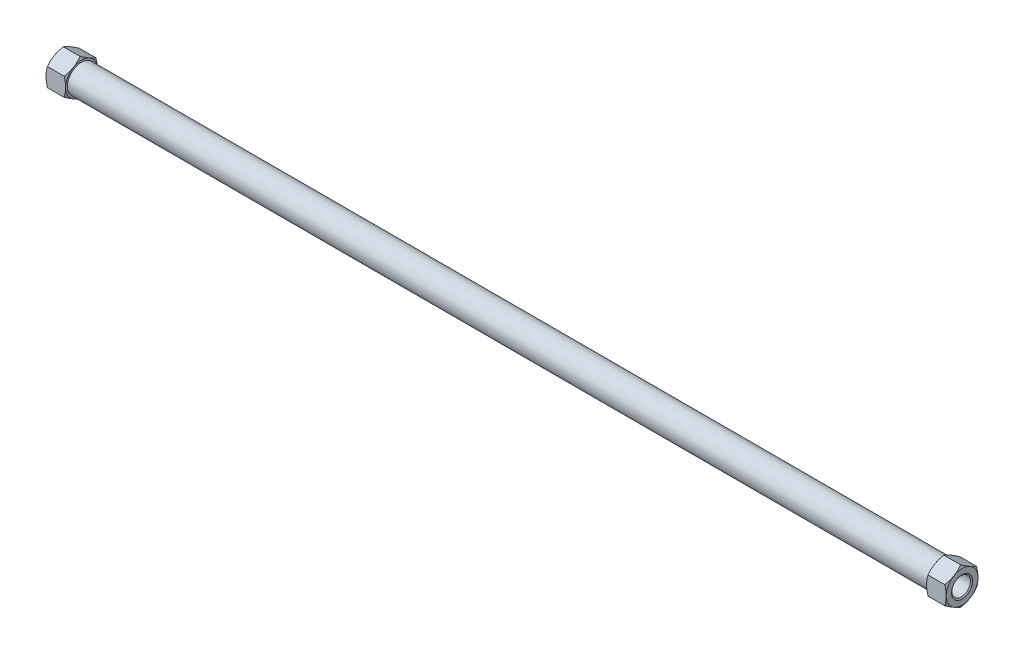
ISO-10303-21;
HEADER;
FILE_DESCRIPTION(('STEP AP214'),'2;1');
FILE_NAME('part.step','',(''),(''),'','','');
FILE_SCHEMA(('AUTOMOTIVE_DESIGN { 1 0 10303 214 1 1 1 1 }'));
ENDSEC;
DATA;
#1=APPLICATION_CONTEXT('core data for automotive mechanical design processes');
#2=APPLICATION_PROTOCOL_DEFINITION('international standard','automotive_design',2000,#1);
#3=PRODUCT_CONTEXT('',#1,'mechanical');
#4=PRODUCT('Part','Part','',(#3));
#5=PRODUCT_RELATED_PRODUCT_CATEGORY('part','',(#4));
#6=PRODUCT_DEFINITION_FORMATION('','',#4);
#7=PRODUCT_DEFINITION_CONTEXT('part definition',#1,'design');
#8=PRODUCT_DEFINITION('design','',#6,#7);
#9=PRODUCT_DEFINITION_SHAPE('','',#8);
#10=(LENGTH_UNIT() NAMED_UNIT(*) SI_UNIT(.MILLI.,.METRE.));
#11=(NAMED_UNIT(*) PLANE_ANGLE_UNIT() SI_UNIT($,.RADIAN.));
#12=(NAMED_UNIT(*) SI_UNIT($,.STERADIAN.) SOLID_ANGLE_UNIT());
#13=UNCERTAINTY_MEASURE_WITH_UNIT(LENGTH_MEASURE(1.E-05),#10,'distance_accuracy_value','');
#14=(GEOMETRIC_REPRESENTATION_CONTEXT(3) GLOBAL_UNCERTAINTY_ASSIGNED_CONTEXT((#13)) GLOBAL_UNIT_ASSIGNED_CONTEXT((#10,
#11,#12)) REPRESENTATION_CONTEXT('',''));
#15=CARTESIAN_POINT('',(0.,0.,0.));
#16=DIRECTION('',(0.,0.,1.));
#17=DIRECTION('',(1.,0.,0.));
#18=AXIS2_PLACEMENT_3D('',#15,#16,#17);
#19=CARTESIAN_POINT('',(339.8,6.9282032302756,12.));
#20=DIRECTION('',(0.,0.866025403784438,0.5));
#21=DIRECTION('',(0.,-0.5,0.866025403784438));
#22=AXIS2_PLACEMENT_3D('',#19,#20,#21);
#23=PLANE('',#22);
#24=CARTESIAN_POINT('',(339.8,10.3923048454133,6.00000000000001));
#25=CARTESIAN_POINT('',(339.800049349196,10.2452732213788,6.25466624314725));
#26=CARTESIAN_POINT('',(339.793760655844,10.0982485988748,6.50932035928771));
#27=CARTESIAN_POINT('',(339.768872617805,9.80448803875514,7.01812857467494));
#28=CARTESIAN_POINT('',(339.750275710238,9.6577520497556,7.272282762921));
#29=CARTESIAN_POINT('',(339.701259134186,9.36551671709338,7.77844920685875));
#30=CARTESIAN_POINT('',(339.67089898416,9.22001485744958,8.03046582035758));
#31=CARTESIAN_POINT('',(339.599004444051,8.92970371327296,8.53329947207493));
#32=CARTESIAN_POINT('',(339.557469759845,8.78489444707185,8.78411647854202));
#33=CARTESIAN_POINT('',(339.46407313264,8.4962933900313,9.28398817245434));
#34=CARTESIAN_POINT('',(339.412223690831,8.35250058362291,9.53304461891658));
#35=CARTESIAN_POINT('',(339.299049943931,8.06585138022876,10.0295356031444));
#36=CARTESIAN_POINT('',(339.237725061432,7.92299504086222,10.2769700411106));
#37=CARTESIAN_POINT('',(339.040244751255,7.49448548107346,11.0191703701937));
#38=CARTESIAN_POINT('',(338.891059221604,7.2103091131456,11.5113782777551));
#39=CARTESIAN_POINT('',(338.728203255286,6.92820327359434,11.9999999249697));
#40=B_SPLINE_CURVE_WITH_KNOTS('',3,(#24,#25,#26,#27,#28,#29,#30,#31,#32,#33,#34,#35,#36,#37,#38,
#39),.UNSPECIFIED.,.F.,.F.,(4,2,2,2,2,2,2,4),(0.,0.882100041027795,1.76402547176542,
2.64154570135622,3.51908903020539,4.39557521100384,5.27211482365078,7.03380278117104),.UNSPECIFIED.);
#41=CARTESIAN_POINT('',(339.8,10.3923048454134,5.99999999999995));
#42=VERTEX_POINT('',#41);
#43=CARTESIAN_POINT('',(338.728203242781,6.92820325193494,11.9999999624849));
#44=VERTEX_POINT('',#43);
#45=EDGE_CURVE('P0_E279',#42,#44,#40,.T.);
#46=ORIENTED_EDGE('',*,*,#45,.F.);
#47=CARTESIAN_POINT('',(338.728203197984,13.8564064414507,-4.19474455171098E-08));
#48=CARTESIAN_POINT('',(338.891059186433,13.5743006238,0.488621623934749));
#49=CARTESIAN_POINT('',(339.040244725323,13.2901242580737,0.980829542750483));
#50=CARTESIAN_POINT('',(339.2377250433,12.8616146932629,1.72302988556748));
#51=CARTESIAN_POINT('',(339.299049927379,12.7187583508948,1.97046432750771));
#52=CARTESIAN_POINT('',(339.412223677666,12.4321091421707,2.4669553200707));
#53=CARTESIAN_POINT('',(339.464073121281,12.2883163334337,2.71601177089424));
#54=CARTESIAN_POINT('',(339.557469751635,11.9997152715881,3.21588347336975));
#55=CARTESIAN_POINT('',(339.599004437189,11.8549060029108,3.4667004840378));
#56=CARTESIAN_POINT('',(339.670898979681,11.5645948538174,3.96953414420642));
#57=CARTESIAN_POINT('',(339.701259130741,11.4190929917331,4.2215507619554));
#58=CARTESIAN_POINT('',(339.750275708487,11.1268576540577,4.72771721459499));
#59=CARTESIAN_POINT('',(339.768872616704,10.9801216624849,4.98187140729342));
#60=CARTESIAN_POINT('',(339.79376065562,10.6863610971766,5.4906796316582));
#61=CARTESIAN_POINT('',(339.800049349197,10.5393364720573,5.74533375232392));
#62=CARTESIAN_POINT('',(339.8,10.3923048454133,6.00000000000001));
#63=B_SPLINE_CURVE_WITH_KNOTS('',3,(#47,#48,#49,#50,#51,#52,#53,#54,#55,#56,#57,#58,#59,#60,#61,
#62),.UNSPECIFIED.,.F.,.F.,(4,2,2,2,2,2,2,4),(0.,1.76168798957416,2.63822761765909,
3.51471381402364,4.39225715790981,5.26977740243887,6.1517028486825,7.03380290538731),.UNSPECIFIED.);
#64=CARTESIAN_POINT('',(338.72820324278,13.8564064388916,-3.751515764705E-08));
#65=VERTEX_POINT('',#64);
#66=EDGE_CURVE('P0_E285',#65,#42,#63,.T.);
#67=ORIENTED_EDGE('',*,*,#66,.F.);
#68=DIRECTION('',(1.,0.,0.));
#69=VECTOR('',#68,1.);
#70=CARTESIAN_POINT('',(339.8,13.8564064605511,0.));
#71=LINE('',#70,#69);
#72=CARTESIAN_POINT('',(326.071796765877,13.8564064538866,1.15430998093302E-08));
#73=VERTEX_POINT('',#72);
#74=EDGE_CURVE('P0_E127',#73,#65,#71,.T.);
#75=ORIENTED_EDGE('',*,*,#74,.F.);
#76=CARTESIAN_POINT('',(325.,10.3923048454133,5.99999999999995));
#77=CARTESIAN_POINT('',(324.999950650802,10.5393364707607,5.74533375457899));
#78=CARTESIAN_POINT('',(325.006239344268,10.6863610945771,5.49067963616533));
#79=CARTESIAN_POINT('',(325.03112738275,10.9801216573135,4.98187141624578));
#80=CARTESIAN_POINT('',(325.049724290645,11.1268576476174,4.72771722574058));
#81=CARTESIAN_POINT('',(325.098740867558,11.4190929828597,4.2215507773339));
#82=CARTESIAN_POINT('',(325.129101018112,11.5645948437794,3.96953416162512));
#83=CARTESIAN_POINT('',(325.200995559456,11.8549059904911,3.46670050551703));
#84=CARTESIAN_POINT('',(325.242530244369,11.9997152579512,3.21588349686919));
#85=CARTESIAN_POINT('',(325.33592687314,12.2883163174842,2.7160117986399));
#86=CARTESIAN_POINT('',(325.387776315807,12.432109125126,2.46695535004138));
#87=CARTESIAN_POINT('',(325.500950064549,12.7187583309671,1.97046436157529));
#88=CARTESIAN_POINT('',(325.562274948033,12.8616146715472,1.72302992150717));
#89=CARTESIAN_POINT('',(325.759755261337,13.2901242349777,0.980829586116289));
#90=CARTESIAN_POINT('',(325.908940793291,13.574300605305,0.488621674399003));
#91=CARTESIAN_POINT('',(326.071796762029,13.8564064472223,2.30861996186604E-08));
#92=B_SPLINE_CURVE_WITH_KNOTS('',3,(#76,#77,#78,#79,#80,#81,#82,#83,#84,#85,#86,#87,#88,#89,#90,
#91),.UNSPECIFIED.,.F.,.F.,(4,2,2,2,2,2,2,4),(0.,0.882100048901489,1.76402548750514,
2.64154572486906,3.5190890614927,4.39557525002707,5.27211487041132,7.03380284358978),.UNSPECIFIED.);
#93=CARTESIAN_POINT('',(325.,10.3923048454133,5.99999999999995));
#94=VERTEX_POINT('',#93);
#95=EDGE_CURVE('P0_E434',#94,#73,#92,.T.);
#96=ORIENTED_EDGE('',*,*,#95,.F.);
#97=CARTESIAN_POINT('',(326.071796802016,6.92820318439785,12.0000000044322));
#98=CARTESIAN_POINT('',(325.908940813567,7.21030905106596,11.5113783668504));
#99=CARTESIAN_POINT('',(325.759755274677,7.49448542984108,11.0191704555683));
#100=CARTESIAN_POINT('',(325.562274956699,7.92299499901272,10.276970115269));
#101=CARTESIAN_POINT('',(325.50095007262,8.06585134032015,10.0295356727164));
#102=CARTESIAN_POINT('',(325.387776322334,8.35250054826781,9.53304467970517));
#103=CARTESIAN_POINT('',(325.335926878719,8.49629335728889,9.28398822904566));
#104=CARTESIAN_POINT('',(325.242530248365,8.78489441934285,8.78411652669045));
#105=CARTESIAN_POINT('',(325.20099556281,8.929703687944,8.53329951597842));
#106=CARTESIAN_POINT('',(325.129101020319,9.22001483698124,8.03046585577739));
#107=CARTESIAN_POINT('',(325.098740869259,9.36551669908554,7.77844923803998));
#108=CARTESIAN_POINT('',(325.049724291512,9.65775203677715,7.27228278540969));
#109=CARTESIAN_POINT('',(325.031127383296,9.80448802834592,7.01812859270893));
#110=CARTESIAN_POINT('',(325.00623934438,10.0982485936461,6.50932036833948));
#111=CARTESIAN_POINT('',(324.999950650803,10.2452732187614,6.25466624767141));
#112=CARTESIAN_POINT('',(325.,10.3923048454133,5.99999999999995));
#113=B_SPLINE_CURVE_WITH_KNOTS('',3,(#97,#98,#99,#100,#101,#102,#103,#104,#105,#106,#107,#108,
#109,#110,#111,#112),.UNSPECIFIED.,.F.,.F.,(4,2,2,2,2,2,2,4),(0.,1.76168798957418,
2.63822761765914,3.51471381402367,4.39225715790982,5.26977740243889,6.15170284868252,
7.03380290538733),.UNSPECIFIED.);
#114=CARTESIAN_POINT('',(326.071796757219,6.92820318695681,12.));
#115=VERTEX_POINT('',#114);
#116=EDGE_CURVE('P0_E425',#115,#94,#113,.T.);
#117=ORIENTED_EDGE('',*,*,#116,.F.);
#118=DIRECTION('',(1.,0.,0.));
#119=VECTOR('',#118,1.);
#120=CARTESIAN_POINT('',(339.8,6.9282032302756,12.));
#121=LINE('',#120,#119);
#122=EDGE_CURVE('P0_E400',#115,#44,#121,.T.);
#123=ORIENTED_EDGE('',*,*,#122,.T.);
#124=EDGE_LOOP('',(#46,#67,#75,#96,#117,#123));
#125=FACE_BOUND('',#124,.T.);
#126=ADVANCED_FACE('P0_F19',(#125),#23,.T.);
#127=CARTESIAN_POINT('',(339.8,6.9282032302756,12.));
#128=DIRECTION('',(0.,0.,-0.999999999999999));
#129=DIRECTION('',(0.,1.,0.));
#130=AXIS2_PLACEMENT_3D('',#127,#128,#129);
#131=PLANE('',#130);
#132=DIRECTION('',(1.,0.,0.));
#133=VECTOR('',#132,1.);
#134=CARTESIAN_POINT('',(339.8,-6.92820323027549,12.));
#135=LINE('',#134,#133);
#136=CARTESIAN_POINT('',(338.728203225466,-6.9282032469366,12.));
#137=VERTEX_POINT('',#136);
#138=CARTESIAN_POINT('',(326.071796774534,-6.92820322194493,12.0000000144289));
#139=VERTEX_POINT('',#138);
#140=EDGE_CURVE('P0_E395',#137,#139,#135,.F.);
#141=ORIENTED_EDGE('',*,*,#140,.F.);
#142=CARTESIAN_POINT('',(339.8,1.66533453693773E-13,12.0000000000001));
#143=CARTESIAN_POINT('',(339.8000493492,-0.294063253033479,12.));
#144=CARTESIAN_POINT('',(339.793760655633,-0.588112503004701,12.));
#145=CARTESIAN_POINT('',(339.768872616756,-1.17563363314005,12.));
#146=CARTESIAN_POINT('',(339.750275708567,-1.46910561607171,12.));
#147=CARTESIAN_POINT('',(339.701259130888,-2.05357629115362,12.));
#148=CARTESIAN_POINT('',(339.670898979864,-2.34458001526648,12.));
#149=CARTESIAN_POINT('',(339.599004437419,-2.92520231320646,12.));
#150=CARTESIAN_POINT('',(339.557469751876,-3.21482085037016,12.));
#151=CARTESIAN_POINT('',(339.46407312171,-3.79202297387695,12.));
#152=CARTESIAN_POINT('',(339.412223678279,-4.0796085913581,12.));
#153=CARTESIAN_POINT('',(339.299049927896,-4.65290700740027,12.));
#154=CARTESIAN_POINT('',(339.237725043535,-4.9386196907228,12.));
#155=CARTESIAN_POINT('',(339.040244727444,-5.79563882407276,12.));
#156=CARTESIAN_POINT('',(338.891059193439,-6.3639915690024,12.));
#157=CARTESIAN_POINT('',(338.728203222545,-6.92820325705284,12.));
#158=B_SPLINE_CURVE_WITH_KNOTS('',3,(#142,#143,#144,#145,#146,#147,#148,#149,#150,#151,#152,
#153,#154,#155,#156,#157),.UNSPECIFIED.,.F.,.F.,(4,2,2,2,2,2,2,4),(0.,0.882100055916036,
1.76402550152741,2.64154574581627,3.5190890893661,4.39557528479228,5.27211491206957,
7.03380289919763),.UNSPECIFIED.);
#159=CARTESIAN_POINT('',(339.8,1.66533453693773E-13,12.0000000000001));
#160=VERTEX_POINT('',#159);
#161=EDGE_CURVE('P0_E251',#160,#137,#158,.T.);
#162=ORIENTED_EDGE('',*,*,#161,.F.);
#163=CARTESIAN_POINT('',(338.728203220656,6.92820326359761,12.));
#164=CARTESIAN_POINT('',(338.891059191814,6.3639915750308,12.));
#165=CARTESIAN_POINT('',(339.04024472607,5.79563882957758,12.));
#166=CARTESIAN_POINT('',(339.237725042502,4.93861969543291,12.));
#167=CARTESIAN_POINT('',(339.29904992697,4.65290701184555,12.));
#168=CARTESIAN_POINT('',(339.412223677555,4.07960859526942,12.));
#169=CARTESIAN_POINT('',(339.46407312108,3.79202297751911,12.));
#170=CARTESIAN_POINT('',(339.557469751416,3.21482085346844,12.));
#171=CARTESIAN_POINT('',(339.599004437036,2.92520231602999,12.));
#172=CARTESIAN_POINT('',(339.670898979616,2.34458001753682,12.));
#173=CARTESIAN_POINT('',(339.701259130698,2.05357629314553,12.));
#174=CARTESIAN_POINT('',(339.75027570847,1.46910561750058,12.));
#175=CARTESIAN_POINT('',(339.768872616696,1.17563363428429,12.));
#176=CARTESIAN_POINT('',(339.793760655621,0.588112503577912,12.));
#177=CARTESIAN_POINT('',(339.8000493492,0.294063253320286,12.));
#178=CARTESIAN_POINT('',(339.8,1.66533453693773E-13,12.0000000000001));
#179=B_SPLINE_CURVE_WITH_KNOTS('',3,(#163,#164,#165,#166,#167,#168,#169,#170,#171,#172,#173,
#174,#175,#176,#177,#178),.UNSPECIFIED.,.F.,.F.,(4,2,2,2,2,2,2,4),(0.,1.76168798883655,
2.63822761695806,3.51471381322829,4.3922571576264,5.26977740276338,6.15170284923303,
7.03380290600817),.UNSPECIFIED.);
#180=EDGE_CURVE('P0_E252',#44,#160,#179,.T.);
#181=ORIENTED_EDGE('',*,*,#180,.F.);
#182=ORIENTED_EDGE('',*,*,#122,.F.);
#183=CARTESIAN_POINT('',(325.,0.,12.));
#184=CARTESIAN_POINT('',(324.999950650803,0.294063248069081,12.));
#185=CARTESIAN_POINT('',(325.006239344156,0.588112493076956,12.));
#186=CARTESIAN_POINT('',(325.031127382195,1.17563361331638,12.));
#187=CARTESIAN_POINT('',(325.049724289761,1.46910559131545,12.));
#188=CARTESIAN_POINT('',(325.098740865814,2.05357625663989,12.));
#189=CARTESIAN_POINT('',(325.12910101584,2.34457997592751,12.));
#190=CARTESIAN_POINT('',(325.200995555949,2.92520226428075,12.));
#191=CARTESIAN_POINT('',(325.242530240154,3.21482079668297,12.));
#192=CARTESIAN_POINT('',(325.33592686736,3.79202291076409,12.));
#193=CARTESIAN_POINT('',(325.387776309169,4.07960852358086,12.));
#194=CARTESIAN_POINT('',(325.500950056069,4.65290693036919,12.));
#195=CARTESIAN_POINT('',(325.562274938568,4.93861960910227,12.));
#196=CARTESIAN_POINT('',(325.759755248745,5.79563872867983,12.));
#197=CARTESIAN_POINT('',(325.908940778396,6.36399146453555,12.));
#198=CARTESIAN_POINT('',(326.071796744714,6.92820314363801,12.));
#199=B_SPLINE_CURVE_WITH_KNOTS('',3,(#183,#184,#185,#186,#187,#188,#189,#190,#191,#192,#193,
#194,#195,#196,#197,#198),.UNSPECIFIED.,.F.,.F.,(4,2,2,2,2,2,2,4),(0.,0.882100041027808,
1.76402547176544,2.64154570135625,3.51908903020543,4.39557521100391,5.27211482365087,
7.03380278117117),.UNSPECIFIED.);
#200=CARTESIAN_POINT('',(325.,0.,12.0000000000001));
#201=VERTEX_POINT('',#200);
#202=EDGE_CURVE('P0_E423',#201,#115,#199,.T.);
#203=ORIENTED_EDGE('',*,*,#202,.F.);
#204=CARTESIAN_POINT('',(326.071796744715,-6.92820314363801,12.));
#205=CARTESIAN_POINT('',(325.908940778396,-6.36399146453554,12.));
#206=CARTESIAN_POINT('',(325.759755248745,-5.79563872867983,12.));
#207=CARTESIAN_POINT('',(325.562274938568,-4.93861960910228,12.));
#208=CARTESIAN_POINT('',(325.500950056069,-4.65290693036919,12.));
#209=CARTESIAN_POINT('',(325.387776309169,-4.07960852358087,12.));
#210=CARTESIAN_POINT('',(325.33592686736,-3.79202291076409,12.));
#211=CARTESIAN_POINT('',(325.242530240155,-3.21482079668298,12.));
#212=CARTESIAN_POINT('',(325.200995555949,-2.92520226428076,12.));
#213=CARTESIAN_POINT('',(325.12910101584,-2.34457997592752,12.));
#214=CARTESIAN_POINT('',(325.098740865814,-2.0535762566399,12.));
#215=CARTESIAN_POINT('',(325.049724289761,-1.46910559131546,12.));
#216=CARTESIAN_POINT('',(325.031127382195,-1.17563361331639,12.));
#217=CARTESIAN_POINT('',(325.006239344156,-0.588112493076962,12.));
#218=CARTESIAN_POINT('',(324.999950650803,-0.294063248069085,12.));
#219=CARTESIAN_POINT('',(325.,0.,12.));
#220=B_SPLINE_CURVE_WITH_KNOTS('',3,(#204,#205,#206,#207,#208,#209,#210,#211,#212,#213,#214,
#215,#216,#217,#218,#219),.UNSPECIFIED.,.F.,.F.,(4,2,2,2,2,2,2,4),(0.,1.76168795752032,
2.6382275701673,3.51471375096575,4.39225707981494,5.26977730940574,6.15170274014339,
7.0338027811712),.UNSPECIFIED.);
#221=EDGE_CURVE('P0_E219',#139,#201,#220,.T.);
#222=ORIENTED_EDGE('',*,*,#221,.F.);
#223=EDGE_LOOP('',(#141,#162,#181,#182,#203,#222));
#224=FACE_BOUND('',#223,.T.);
#225=ADVANCED_FACE('P0_F228',(#224),#131,.F.);
#226=CARTESIAN_POINT('',(339.8,-13.8564064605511,0.));
#227=DIRECTION('',(0.,-0.866025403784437,0.500000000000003));
#228=DIRECTION('',(0.,-0.500000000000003,-0.866025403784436));
#229=AXIS2_PLACEMENT_3D('',#226,#227,#228);
#230=PLANE('',#229);
#231=CARTESIAN_POINT('',(339.8,-10.3923048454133,6.00000000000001));
#232=CARTESIAN_POINT('',(339.800049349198,-10.539336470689,5.74533375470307));
#233=CARTESIAN_POINT('',(339.793760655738,-10.6863610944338,5.49067963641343));
#234=CARTESIAN_POINT('',(339.76887261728,-10.9801216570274,4.98187141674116));
#235=CARTESIAN_POINT('',(339.750275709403,-11.1268576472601,4.72771722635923));
#236=CARTESIAN_POINT('',(339.701259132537,-11.4190929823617,4.22155077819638));
#237=CARTESIAN_POINT('',(339.670898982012,-11.5645948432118,3.96953416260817));
#238=CARTESIAN_POINT('',(339.599004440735,-11.8549059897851,3.46670050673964));
#239=CARTESIAN_POINT('',(339.557469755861,-11.9997152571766,3.21588349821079));
#240=CARTESIAN_POINT('',(339.464073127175,-12.2883163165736,2.71601180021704));
#241=CARTESIAN_POINT('',(339.412223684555,-12.432109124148,2.46695535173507));
#242=CARTESIAN_POINT('',(339.299049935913,-12.7187583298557,1.97046436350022));
#243=CARTESIAN_POINT('',(339.237725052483,-12.8616146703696,1.72302992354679));
#244=CARTESIAN_POINT('',(339.04024473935,-13.2901242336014,0.980829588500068));
#245=CARTESIAN_POINT('',(338.891059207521,-13.5743006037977,0.488621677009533));
#246=CARTESIAN_POINT('',(338.728203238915,-13.8564064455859,2.59203214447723E-08));
#247=B_SPLINE_CURVE_WITH_KNOTS('',3,(#231,#232,#233,#234,#235,#236,#237,#238,#239,#240,#241,
#242,#243,#244,#245,#246),.UNSPECIFIED.,.F.,.F.,(4,2,2,2,2,2,2,4),(0.,0.882100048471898,
1.76402548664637,2.64154572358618,3.51908905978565,4.39557524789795,5.27211486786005,
7.03380284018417),.UNSPECIFIED.);
#248=CARTESIAN_POINT('',(339.8,-10.3923048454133,6.00000000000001));
#249=VERTEX_POINT('',#248);
#250=CARTESIAN_POINT('',(338.728203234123,-13.8564064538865,1.15430998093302E-08));
#251=VERTEX_POINT('',#250);
#252=EDGE_CURVE('P0_E234',#249,#251,#247,.T.);
#253=ORIENTED_EDGE('',*,*,#252,.F.);
#254=CARTESIAN_POINT('',(338.728203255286,-6.92820327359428,11.9999999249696));
#255=CARTESIAN_POINT('',(338.891059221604,-7.21030911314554,11.511378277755));
#256=CARTESIAN_POINT('',(339.040244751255,-7.49448548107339,11.0191703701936));
#257=CARTESIAN_POINT('',(339.237725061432,-7.92299504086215,10.2769700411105));
#258=CARTESIAN_POINT('',(339.299049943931,-8.06585138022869,10.0295356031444));
#259=CARTESIAN_POINT('',(339.412223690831,-8.35250058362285,9.53304461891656));
#260=CARTESIAN_POINT('',(339.46407313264,-8.49629339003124,9.28398817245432));
#261=CARTESIAN_POINT('',(339.557469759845,-8.78489444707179,8.784116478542));
#262=CARTESIAN_POINT('',(339.599004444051,-8.92970371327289,8.53329947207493));
#263=CARTESIAN_POINT('',(339.67089898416,-9.22001485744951,8.03046582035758));
#264=CARTESIAN_POINT('',(339.701259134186,-9.36551671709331,7.77844920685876));
#265=CARTESIAN_POINT('',(339.750275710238,-9.65775204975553,7.27228276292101));
#266=CARTESIAN_POINT('',(339.768872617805,-9.80448803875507,7.01812857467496));
#267=CARTESIAN_POINT('',(339.793760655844,-10.0982485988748,6.50932035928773));
#268=CARTESIAN_POINT('',(339.800049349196,-10.2452732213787,6.25466624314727));
#269=CARTESIAN_POINT('',(339.8,-10.3923048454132,6.00000000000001));
#270=B_SPLINE_CURVE_WITH_KNOTS('',3,(#254,#255,#256,#257,#258,#259,#260,#261,#262,#263,#264,
#265,#266,#267,#268,#269),.UNSPECIFIED.,.F.,.F.,(4,2,2,2,2,2,2,4),(0.,1.76168795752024,
2.6382275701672,3.51471375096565,4.3922570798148,5.26977730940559,6.15170274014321,
7.033802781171),.UNSPECIFIED.);
#271=EDGE_CURVE('P0_E244',#137,#249,#270,.T.);
#272=ORIENTED_EDGE('',*,*,#271,.F.);
#273=ORIENTED_EDGE('',*,*,#140,.T.);
#274=CARTESIAN_POINT('',(325.,-10.3923048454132,5.99999999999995));
#275=CARTESIAN_POINT('',(324.9999506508,-10.2452732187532,6.25466624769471));
#276=CARTESIAN_POINT('',(325.006239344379,-10.0982485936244,6.5093203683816));
#277=CARTESIAN_POINT('',(325.031127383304,-9.80448802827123,7.01812859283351));
#278=CARTESIAN_POINT('',(325.04972429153,-9.65775203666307,7.27228278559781));
#279=CARTESIAN_POINT('',(325.098740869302,-9.36551669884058,7.77844923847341));
#280=CARTESIAN_POINT('',(325.129101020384,-9.22001483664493,8.03046585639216));
#281=CARTESIAN_POINT('',(325.200995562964,-8.92970368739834,8.53329951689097));
#282=CARTESIAN_POINT('',(325.242530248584,-8.7848944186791,8.78411652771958));
#283=CARTESIAN_POINT('',(325.33592687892,-8.49629335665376,9.28398823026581));
#284=CARTESIAN_POINT('',(325.387776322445,-8.3525005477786,9.53304468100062));
#285=CARTESIAN_POINT('',(325.50095007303,-8.06585133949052,10.029535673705));
#286=CARTESIAN_POINT('',(325.562274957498,-7.92299499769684,10.276970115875));
#287=CARTESIAN_POINT('',(325.75975527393,-7.49448543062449,11.0191704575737));
#288=CARTESIAN_POINT('',(325.908940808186,-7.21030905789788,11.5113783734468));
#289=CARTESIAN_POINT('',(326.071796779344,-6.92820321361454,12.0000000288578));
#290=B_SPLINE_CURVE_WITH_KNOTS('',3,(#274,#275,#276,#277,#278,#279,#280,#281,#282,#283,#284,
#285,#286,#287,#288,#289),.UNSPECIFIED.,.F.,.F.,(4,2,2,2,2,2,2,4),(0.,0.882100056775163,
1.76402550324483,2.64154574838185,3.51908909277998,4.39557528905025,5.27211491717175,
7.03380290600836),.UNSPECIFIED.);
#291=CARTESIAN_POINT('',(325.,-10.3923048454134,6.00000000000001));
#292=VERTEX_POINT('',#291);
#293=EDGE_CURVE('P0_E212',#292,#139,#290,.T.);
#294=ORIENTED_EDGE('',*,*,#293,.F.);
#295=CARTESIAN_POINT('',(326.071796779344,-13.8564064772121,-2.88578050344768E-08));
#296=CARTESIAN_POINT('',(325.908940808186,-13.5743006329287,0.488621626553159));
#297=CARTESIAN_POINT('',(325.75975527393,-13.2901242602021,0.980829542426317));
#298=CARTESIAN_POINT('',(325.562274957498,-12.8616146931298,1.72302988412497));
#299=CARTESIAN_POINT('',(325.50095007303,-12.7187583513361,1.97046432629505));
#300=CARTESIAN_POINT('',(325.387776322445,-12.432109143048,2.46695531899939));
#301=CARTESIAN_POINT('',(325.33592687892,-12.2883163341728,2.7160117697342));
#302=CARTESIAN_POINT('',(325.242530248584,-11.9997152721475,3.21588347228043));
#303=CARTESIAN_POINT('',(325.200995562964,-11.8549060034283,3.46670048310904));
#304=CARTESIAN_POINT('',(325.129101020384,-11.5645948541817,3.96953414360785));
#305=CARTESIAN_POINT('',(325.098740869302,-11.419092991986,4.22155076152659));
#306=CARTESIAN_POINT('',(325.04972429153,-11.1268576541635,4.72771721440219));
#307=CARTESIAN_POINT('',(325.031127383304,-10.9801216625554,4.9818714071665));
#308=CARTESIAN_POINT('',(325.006239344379,-10.6863610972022,5.49067963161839));
#309=CARTESIAN_POINT('',(324.9999506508,-10.5393364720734,5.74533375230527));
#310=CARTESIAN_POINT('',(325.,-10.3923048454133,6.00000000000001));
#311=B_SPLINE_CURVE_WITH_KNOTS('',3,(#295,#296,#297,#298,#299,#300,#301,#302,#303,#304,#305,
#306,#307,#308,#309,#310),.UNSPECIFIED.,.F.,.F.,(4,2,2,2,2,2,2,4),(0.,1.7616879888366,
2.63822761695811,3.51471381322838,4.39225715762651,5.26977740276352,6.15170284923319,
7.03380290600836),.UNSPECIFIED.);
#312=CARTESIAN_POINT('',(326.07179675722,-13.8564064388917,-3.75152131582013E-08));
#313=VERTEX_POINT('',#312);
#314=EDGE_CURVE('P0_E184',#313,#292,#311,.T.);
#315=ORIENTED_EDGE('',*,*,#314,.F.);
#316=DIRECTION('',(1.,0.,0.));
#317=VECTOR('',#316,1.);
#318=CARTESIAN_POINT('',(339.8,-13.8564064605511,0.));
#319=LINE('',#318,#317);
#320=EDGE_CURVE('P0_E376',#251,#313,#319,.F.);
#321=ORIENTED_EDGE('',*,*,#320,.F.);
#322=EDGE_LOOP('',(#253,#272,#273,#294,#315,#321));
#323=FACE_BOUND('',#322,.T.);
#324=ADVANCED_FACE('P0_F225',(#323),#230,.T.);
#325=CARTESIAN_POINT('',(339.8,-6.9282032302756,-12.));
#326=DIRECTION('',(0.,-0.866025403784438,-0.5));
#327=DIRECTION('',(0.,0.5,-0.866025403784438));
#328=AXIS2_PLACEMENT_3D('',#325,#326,#327);
#329=PLANE('',#328);
#330=CARTESIAN_POINT('',(339.8,-10.3923048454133,-6.00000000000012));
#331=CARTESIAN_POINT('',(339.800049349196,-10.2452732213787,-6.25466624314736));
#332=CARTESIAN_POINT('',(339.793760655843,-10.0982485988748,-6.50932035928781));
#333=CARTESIAN_POINT('',(339.768872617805,-9.80448803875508,-7.01812857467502));
#334=CARTESIAN_POINT('',(339.750275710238,-9.65775204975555,-7.27228276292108));
#335=CARTESIAN_POINT('',(339.701259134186,-9.36551671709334,-7.77844920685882));
#336=CARTESIAN_POINT('',(339.67089898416,-9.22001485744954,-8.03046582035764));
#337=CARTESIAN_POINT('',(339.599004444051,-8.92970371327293,-8.53329947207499));
#338=CARTESIAN_POINT('',(339.557469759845,-8.78489444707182,-8.78411647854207));
#339=CARTESIAN_POINT('',(339.46407313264,-8.49629339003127,-9.28398817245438));
#340=CARTESIAN_POINT('',(339.412223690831,-8.35250058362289,-9.53304461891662));
#341=CARTESIAN_POINT('',(339.299049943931,-8.06585138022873,-10.0295356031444));
#342=CARTESIAN_POINT('',(339.237725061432,-7.9229950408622,-10.2769700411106));
#343=CARTESIAN_POINT('',(339.040244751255,-7.49448548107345,-11.0191703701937));
#344=CARTESIAN_POINT('',(338.891059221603,-7.21030911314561,-11.5113782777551));
#345=CARTESIAN_POINT('',(338.728203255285,-6.92820327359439,-11.9999999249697));
#346=B_SPLINE_CURVE_WITH_KNOTS('',3,(#330,#331,#332,#333,#334,#335,#336,#337,#338,#339,#340,
#341,#342,#343,#344,#345),.UNSPECIFIED.,.F.,.F.,(4,2,2,2,2,2,2,4),(0.,0.882100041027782,
1.76402547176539,2.64154570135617,3.51908903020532,4.39557521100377,5.2721148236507,
7.03380278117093),.UNSPECIFIED.);
#347=CARTESIAN_POINT('',(339.8,-10.3923048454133,-6.00000000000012));
#348=VERTEX_POINT('',#347);
#349=CARTESIAN_POINT('',(338.728203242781,-6.92820325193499,-11.9999999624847));
#350=VERTEX_POINT('',#349);
#351=EDGE_CURVE('P0_E23',#348,#350,#346,.T.);
#352=ORIENTED_EDGE('',*,*,#351,.F.);
#353=CARTESIAN_POINT('',(338.728203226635,-13.8564064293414,-1.65414903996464E-08));
#354=CARTESIAN_POINT('',(338.891059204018,-13.5743006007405,-0.488621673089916));
#355=CARTESIAN_POINT('',(339.040244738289,-13.2901242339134,-0.980829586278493));
#356=CARTESIAN_POINT('',(339.237725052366,-12.8616146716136,-1.72302992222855));
#357=CARTESIAN_POINT('',(339.299049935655,-12.7187583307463,-1.97046436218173));
#358=CARTESIAN_POINT('',(339.412223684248,-12.4321091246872,-2.46695535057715));
#359=CARTESIAN_POINT('',(339.46407312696,-12.2883163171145,-2.71601179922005));
#360=CARTESIAN_POINT('',(339.55746975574,-11.9997152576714,-3.21588349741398));
#361=CARTESIAN_POINT('',(339.59900444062,-11.8549059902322,-3.46670050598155));
#362=CARTESIAN_POINT('',(339.67089898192,-11.5645948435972,-3.96953416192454));
#363=CARTESIAN_POINT('',(339.701259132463,-11.4190929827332,-4.22155077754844));
#364=CARTESIAN_POINT('',(339.750275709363,-11.1268576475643,-4.72771722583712));
#365=CARTESIAN_POINT('',(339.768872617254,-10.9801216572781,-4.98187141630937));
#366=CARTESIAN_POINT('',(339.793760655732,-10.6863610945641,-5.49067963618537));
#367=CARTESIAN_POINT('',(339.800049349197,-10.5393364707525,-5.74533375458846));
#368=CARTESIAN_POINT('',(339.8,-10.3923048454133,-6.00000000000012));
#369=B_SPLINE_CURVE_WITH_KNOTS('',3,(#353,#354,#355,#356,#357,#358,#359,#360,#361,#362,#363,
#364,#365,#366,#367,#368),.UNSPECIFIED.,.F.,.F.,(4,2,2,2,2,2,2,4),(0.,1.76168797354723,
2.63822759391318,3.5147137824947,4.39225711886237,5.26977735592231,6.15170279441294,
7.03380284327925),.UNSPECIFIED.);
#370=EDGE_CURVE('P0_E112',#251,#348,#369,.T.);
#371=ORIENTED_EDGE('',*,*,#370,.F.);
#372=ORIENTED_EDGE('',*,*,#320,.T.);
#373=CARTESIAN_POINT('',(325.,-10.3923048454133,-6.00000000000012));
#374=CARTESIAN_POINT('',(324.999950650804,-10.5393364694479,-5.74533375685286));
#375=CARTESIAN_POINT('',(325.006239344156,-10.6863610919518,-5.4906796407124));
#376=CARTESIAN_POINT('',(325.031127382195,-10.9801216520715,-4.98187142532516));
#377=CARTESIAN_POINT('',(325.049724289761,-11.1268576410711,-4.7277172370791));
#378=CARTESIAN_POINT('',(325.098740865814,-11.4190929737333,-4.22155079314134));
#379=CARTESIAN_POINT('',(325.12910101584,-11.5645948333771,-3.96953417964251));
#380=CARTESIAN_POINT('',(325.200995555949,-11.8549059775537,-3.46670052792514));
#381=CARTESIAN_POINT('',(325.242530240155,-11.9997152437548,-3.21588352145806));
#382=CARTESIAN_POINT('',(325.33592686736,-12.2883163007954,-2.71601182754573));
#383=CARTESIAN_POINT('',(325.387776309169,-12.4321091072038,-2.46695538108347));
#384=CARTESIAN_POINT('',(325.500950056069,-12.7187583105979,-1.97046439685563));
#385=CARTESIAN_POINT('',(325.562274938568,-12.8616146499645,-1.72302995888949));
#386=CARTESIAN_POINT('',(325.759755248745,-13.2901242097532,-0.980829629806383));
#387=CARTESIAN_POINT('',(325.908940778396,-13.5743005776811,-0.488621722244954));
#388=CARTESIAN_POINT('',(326.071796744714,-13.8564064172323,-7.50303152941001E-08));
#389=B_SPLINE_CURVE_WITH_KNOTS('',3,(#373,#374,#375,#376,#377,#378,#379,#380,#381,#382,#383,
#384,#385,#386,#387,#388),.UNSPECIFIED.,.F.,.F.,(4,2,2,2,2,2,2,4),(0.,0.88210004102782,
1.76402547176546,2.64154570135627,3.51908903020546,4.39557521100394,5.27211482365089,
7.03380278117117),.UNSPECIFIED.);
#390=CARTESIAN_POINT('',(325.,-10.3923048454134,-6.00000000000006));
#391=VERTEX_POINT('',#390);
#392=EDGE_CURVE('P0_E205',#391,#313,#389,.T.);
#393=ORIENTED_EDGE('',*,*,#392,.F.);
#394=CARTESIAN_POINT('',(326.071796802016,-6.92820318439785,-12.0000000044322));
#395=CARTESIAN_POINT('',(325.908940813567,-7.21030905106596,-11.5113783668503));
#396=CARTESIAN_POINT('',(325.759755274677,-7.49448542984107,-11.0191704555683));
#397=CARTESIAN_POINT('',(325.562274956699,-7.9229949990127,-10.276970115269));
#398=CARTESIAN_POINT('',(325.50095007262,-8.06585134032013,-10.0295356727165));
#399=CARTESIAN_POINT('',(325.387776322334,-8.35250054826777,-9.5330446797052));
#400=CARTESIAN_POINT('',(325.335926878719,-8.49629335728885,-9.28398822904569));
#401=CARTESIAN_POINT('',(325.242530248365,-8.78489441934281,-8.78411652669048));
#402=CARTESIAN_POINT('',(325.20099556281,-8.92970368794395,-8.53329951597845));
#403=CARTESIAN_POINT('',(325.129101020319,-9.22001483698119,-8.03046585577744));
#404=CARTESIAN_POINT('',(325.098740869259,-9.36551669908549,-7.77844923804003));
#405=CARTESIAN_POINT('',(325.049724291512,-9.65775203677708,-7.27228278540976));
#406=CARTESIAN_POINT('',(325.031127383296,-9.80448802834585,-7.018128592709));
#407=CARTESIAN_POINT('',(325.00623934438,-10.098248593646,-6.50932036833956));
#408=CARTESIAN_POINT('',(324.999950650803,-10.2452732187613,-6.25466624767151));
#409=CARTESIAN_POINT('',(325.,-10.3923048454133,-6.00000000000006));
#410=B_SPLINE_CURVE_WITH_KNOTS('',3,(#394,#395,#396,#397,#398,#399,#400,#401,#402,#403,#404,
#405,#406,#407,#408,#409),.UNSPECIFIED.,.F.,.F.,(4,2,2,2,2,2,2,4),(0.,1.76168798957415,
2.63822761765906,3.51471381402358,4.39225715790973,5.26977740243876,6.15170284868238,
7.03380290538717),.UNSPECIFIED.);
#411=CARTESIAN_POINT('',(326.071796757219,-6.92820318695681,-12.));
#412=VERTEX_POINT('',#411);
#413=EDGE_CURVE('P0_E138',#412,#391,#410,.T.);
#414=ORIENTED_EDGE('',*,*,#413,.F.);
#415=DIRECTION('',(1.,0.,0.));
#416=VECTOR('',#415,1.);
#417=CARTESIAN_POINT('',(339.8,-6.9282032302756,-12.));
#418=LINE('',#417,#416);
#419=EDGE_CURVE('P0_E128',#350,#412,#418,.F.);
#420=ORIENTED_EDGE('',*,*,#419,.F.);
#421=EDGE_LOOP('',(#352,#371,#372,#393,#414,#420));
#422=FACE_BOUND('',#421,.T.);
#423=ADVANCED_FACE('P0_F163',(#422),#329,.T.);
#424=CARTESIAN_POINT('',(339.8,6.92820323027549,-12.));
#425=DIRECTION('',(0.,0.,-0.999999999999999));
#426=DIRECTION('',(0.,1.,0.));
#427=AXIS2_PLACEMENT_3D('',#424,#425,#426);
#428=PLANE('',#427);
#429=CARTESIAN_POINT('',(339.8,0.,-12.));
#430=CARTESIAN_POINT('',(339.8000493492,0.294063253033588,-12.));
#431=CARTESIAN_POINT('',(339.793760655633,0.588112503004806,-12.));
#432=CARTESIAN_POINT('',(339.768872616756,1.17563363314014,-11.9999999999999));
#433=CARTESIAN_POINT('',(339.750275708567,1.4691056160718,-11.9999999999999));
#434=CARTESIAN_POINT('',(339.701259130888,2.0535762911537,-11.9999999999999));
#435=CARTESIAN_POINT('',(339.670898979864,2.34458001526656,-11.9999999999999));
#436=CARTESIAN_POINT('',(339.599004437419,2.92520231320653,-11.9999999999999));
#437=CARTESIAN_POINT('',(339.557469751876,3.21482085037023,-11.9999999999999));
#438=CARTESIAN_POINT('',(339.464073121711,3.79202297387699,-11.9999999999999));
#439=CARTESIAN_POINT('',(339.412223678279,4.07960859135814,-12.));
#440=CARTESIAN_POINT('',(339.299049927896,4.65290700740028,-12.));
#441=CARTESIAN_POINT('',(339.237725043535,4.93861969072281,-12.));
#442=CARTESIAN_POINT('',(339.040244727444,5.79563882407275,-12.));
#443=CARTESIAN_POINT('',(338.891059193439,6.36399156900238,-12.));
#444=CARTESIAN_POINT('',(338.728203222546,6.92820325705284,-12.));
#445=B_SPLINE_CURVE_WITH_KNOTS('',3,(#429,#430,#431,#432,#433,#434,#435,#436,#437,#438,#439,
#440,#441,#442,#443,#444),.UNSPECIFIED.,.F.,.F.,(4,2,2,2,2,2,2,4),(0.,0.882100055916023,
1.76402550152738,2.64154574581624,3.51908908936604,4.39557528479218,5.27211491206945,
7.0338028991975),.UNSPECIFIED.);
#446=CARTESIAN_POINT('',(339.8,0.,-12.));
#447=VERTEX_POINT('',#446);
#448=CARTESIAN_POINT('',(338.728203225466,6.92820324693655,-12.));
#449=VERTEX_POINT('',#448);
#450=EDGE_CURVE('P0_E170',#447,#449,#445,.T.);
#451=ORIENTED_EDGE('',*,*,#450,.F.);
#452=CARTESIAN_POINT('',(338.728203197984,-6.92820325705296,-11.9999999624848));
#453=CARTESIAN_POINT('',(338.891059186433,-6.36399157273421,-11.999999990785));
#454=CARTESIAN_POINT('',(339.040244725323,-5.79563882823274,-11.9999999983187));
#455=CARTESIAN_POINT('',(339.2377250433,-4.93861969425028,-12.0000000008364));
#456=CARTESIAN_POINT('',(339.299049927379,-4.65290701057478,-12.0000000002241));
#457=CARTESIAN_POINT('',(339.412223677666,-4.07960859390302,-11.9999999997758));
#458=CARTESIAN_POINT('',(339.464073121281,-3.79202297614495,-11.9999999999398));
#459=CARTESIAN_POINT('',(339.557469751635,-3.21482085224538,-12.0000000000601));
#460=CARTESIAN_POINT('',(339.59900443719,-2.92520231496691,-12.0000000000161));
#461=CARTESIAN_POINT('',(339.670898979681,-2.34458001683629,-11.9999999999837));
#462=CARTESIAN_POINT('',(339.701259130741,-2.0535762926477,-11.9999999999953));
#463=CARTESIAN_POINT('',(339.750275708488,-1.46910561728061,-12.0000000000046));
#464=CARTESIAN_POINT('',(339.768872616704,-1.17563363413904,-12.0000000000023));
#465=CARTESIAN_POINT('',(339.79376065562,-0.58811250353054,-11.9999999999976));
#466=CARTESIAN_POINT('',(339.800049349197,-0.294063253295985,-11.9999999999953));
#467=CARTESIAN_POINT('',(339.8,0.,-12.));
#468=B_SPLINE_CURVE_WITH_KNOTS('',3,(#452,#453,#454,#455,#456,#457,#458,#459,#460,#461,#462,
#463,#464,#465,#466,#467),.UNSPECIFIED.,.F.,.F.,(4,2,2,2,2,2,2,4),(0.,1.76168798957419,
2.63822761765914,3.51471381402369,4.39225715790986,5.26977740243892,6.15170284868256,
7.03380290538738),.UNSPECIFIED.);
#469=EDGE_CURVE('P0_E301',#350,#447,#468,.T.);
#470=ORIENTED_EDGE('',*,*,#469,.F.);
#471=ORIENTED_EDGE('',*,*,#419,.T.);
#472=CARTESIAN_POINT('',(325.,0.,-12.));
#473=CARTESIAN_POINT('',(324.999950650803,-0.294063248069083,-12.));
#474=CARTESIAN_POINT('',(325.006239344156,-0.588112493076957,-11.9999999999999));
#475=CARTESIAN_POINT('',(325.031127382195,-1.17563361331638,-11.9999999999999));
#476=CARTESIAN_POINT('',(325.049724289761,-1.46910559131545,-11.9999999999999));
#477=CARTESIAN_POINT('',(325.098740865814,-2.05357625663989,-11.9999999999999));
#478=CARTESIAN_POINT('',(325.12910101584,-2.3445799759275,-11.9999999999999));
#479=CARTESIAN_POINT('',(325.200995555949,-2.92520226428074,-11.9999999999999));
#480=CARTESIAN_POINT('',(325.242530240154,-3.21482079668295,-11.9999999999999));
#481=CARTESIAN_POINT('',(325.33592686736,-3.79202291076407,-11.9999999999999));
#482=CARTESIAN_POINT('',(325.387776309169,-4.07960852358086,-11.9999999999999));
#483=CARTESIAN_POINT('',(325.500950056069,-4.65290693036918,-11.9999999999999));
#484=CARTESIAN_POINT('',(325.562274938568,-4.93861960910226,-11.9999999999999));
#485=CARTESIAN_POINT('',(325.759755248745,-5.79563872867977,-11.9999999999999));
#486=CARTESIAN_POINT('',(325.908940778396,-6.36399146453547,-11.9999999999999));
#487=CARTESIAN_POINT('',(326.071796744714,-6.92820314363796,-12.));
#488=B_SPLINE_CURVE_WITH_KNOTS('',3,(#472,#473,#474,#475,#476,#477,#478,#479,#480,#481,#482,
#483,#484,#485,#486,#487),.UNSPECIFIED.,.F.,.F.,(4,2,2,2,2,2,2,4),(0.,0.882100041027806,
1.76402547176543,2.64154570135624,3.51908903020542,4.3955752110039,5.27211482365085,
7.03380278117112),.UNSPECIFIED.);
#489=CARTESIAN_POINT('',(325.,0.,-12.));
#490=VERTEX_POINT('',#489);
#491=EDGE_CURVE('P0_E137',#490,#412,#488,.T.);
#492=ORIENTED_EDGE('',*,*,#491,.F.);
#493=CARTESIAN_POINT('',(326.071796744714,6.92820314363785,-12.));
#494=CARTESIAN_POINT('',(325.908940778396,6.36399146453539,-12.));
#495=CARTESIAN_POINT('',(325.759755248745,5.79563872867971,-12.));
#496=CARTESIAN_POINT('',(325.562274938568,4.93861960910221,-11.9999999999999));
#497=CARTESIAN_POINT('',(325.500950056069,4.65290693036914,-11.9999999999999));
#498=CARTESIAN_POINT('',(325.387776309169,4.07960852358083,-11.9999999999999));
#499=CARTESIAN_POINT('',(325.33592686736,3.79202291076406,-11.9999999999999));
#500=CARTESIAN_POINT('',(325.242530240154,3.21482079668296,-11.9999999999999));
#501=CARTESIAN_POINT('',(325.200995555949,2.92520226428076,-11.9999999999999));
#502=CARTESIAN_POINT('',(325.12910101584,2.34457997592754,-11.9999999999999));
#503=CARTESIAN_POINT('',(325.098740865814,2.05357625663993,-11.9999999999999));
#504=CARTESIAN_POINT('',(325.049724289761,1.46910559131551,-11.9999999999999));
#505=CARTESIAN_POINT('',(325.031127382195,1.17563361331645,-11.9999999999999));
#506=CARTESIAN_POINT('',(325.006239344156,0.588112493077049,-11.9999999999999));
#507=CARTESIAN_POINT('',(324.999950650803,0.294063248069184,-12.));
#508=CARTESIAN_POINT('',(325.,0.,-12.));
#509=B_SPLINE_CURVE_WITH_KNOTS('',3,(#493,#494,#495,#496,#497,#498,#499,#500,#501,#502,#503,
#504,#505,#506,#507,#508),.UNSPECIFIED.,.F.,.F.,(4,2,2,2,2,2,2,4),(0.,1.76168795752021,
2.63822757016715,3.51471375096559,4.39225707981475,5.26977730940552,6.15170274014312,
7.0338027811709),.UNSPECIFIED.);
#510=CARTESIAN_POINT('',(326.071796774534,6.92820322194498,-12.0000000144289));
#511=VERTEX_POINT('',#510);
#512=EDGE_CURVE('P0_E44',#511,#490,#509,.T.);
#513=ORIENTED_EDGE('',*,*,#512,.F.);
#514=DIRECTION('',(1.,0.,0.));
#515=VECTOR('',#514,1.);
#516=CARTESIAN_POINT('',(339.8,6.9282032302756,-12.));
#517=LINE('',#516,#515);
#518=EDGE_CURVE('P0_E118',#449,#511,#517,.F.);
#519=ORIENTED_EDGE('',*,*,#518,.F.);
#520=EDGE_LOOP('',(#451,#470,#471,#492,#513,#519));
#521=FACE_BOUND('',#520,.T.);
#522=ADVANCED_FACE('P0_F135',(#521),#428,.T.);
#523=CARTESIAN_POINT('',(339.8,13.8564064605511,0.));
#524=DIRECTION('',(0.,0.866025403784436,-0.500000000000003));
#525=DIRECTION('',(0.,0.500000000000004,0.866025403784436));
#526=AXIS2_PLACEMENT_3D('',#523,#524,#525);
#527=PLANE('',#526);
#528=CARTESIAN_POINT('',(339.8,10.3923048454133,-6.00000000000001));
#529=CARTESIAN_POINT('',(339.800049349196,10.5393364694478,-5.74533375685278));
#530=CARTESIAN_POINT('',(339.793760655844,10.6863610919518,-5.49067964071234));
#531=CARTESIAN_POINT('',(339.768872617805,10.9801216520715,-4.98187142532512));
#532=CARTESIAN_POINT('',(339.750275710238,11.126857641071,-4.72771723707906));
#533=CARTESIAN_POINT('',(339.701259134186,11.4190929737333,-4.2215507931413));
#534=CARTESIAN_POINT('',(339.67089898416,11.5645948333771,-3.96953417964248));
#535=CARTESIAN_POINT('',(339.599004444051,11.8549059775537,-3.46670052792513));
#536=CARTESIAN_POINT('',(339.557469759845,11.9997152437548,-3.21588352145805));
#537=CARTESIAN_POINT('',(339.46407313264,12.2883163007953,-2.71601182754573));
#538=CARTESIAN_POINT('',(339.412223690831,12.4321091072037,-2.46695538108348));
#539=CARTESIAN_POINT('',(339.299049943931,12.7187583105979,-1.97046439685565));
#540=CARTESIAN_POINT('',(339.237725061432,12.8616146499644,-1.7230299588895));
#541=CARTESIAN_POINT('',(339.040244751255,13.2901242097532,-0.980829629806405));
#542=CARTESIAN_POINT('',(338.891059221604,13.5743005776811,-0.488621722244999));
#543=CARTESIAN_POINT('',(338.728203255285,13.8564064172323,-7.50304263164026E-08));
#544=B_SPLINE_CURVE_WITH_KNOTS('',3,(#528,#529,#530,#531,#532,#533,#534,#535,#536,#537,#538,
#539,#540,#541,#542,#543),.UNSPECIFIED.,.F.,.F.,(4,2,2,2,2,2,2,4),(0.,0.882100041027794,
1.76402547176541,2.64154570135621,3.51908903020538,4.39557521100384,5.27211482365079,
7.03380278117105),.UNSPECIFIED.);
#545=CARTESIAN_POINT('',(339.8,10.3923048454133,-6.00000000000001));
#546=VERTEX_POINT('',#545);
#547=EDGE_CURVE('P0_E290',#546,#65,#544,.T.);
#548=ORIENTED_EDGE('',*,*,#547,.F.);
#549=CARTESIAN_POINT('',(338.728203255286,6.92820327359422,-11.9999999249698));
#550=CARTESIAN_POINT('',(338.891059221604,7.21030911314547,-11.5113782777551));
#551=CARTESIAN_POINT('',(339.040244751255,7.49448548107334,-11.0191703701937));
#552=CARTESIAN_POINT('',(339.237725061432,7.92299504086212,-10.2769700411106));
#553=CARTESIAN_POINT('',(339.299049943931,8.06585138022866,-10.0295356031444));
#554=CARTESIAN_POINT('',(339.412223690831,8.35250058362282,-9.53304461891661));
#555=CARTESIAN_POINT('',(339.46407313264,8.49629339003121,-9.28398817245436));
#556=CARTESIAN_POINT('',(339.557469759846,8.78489444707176,-8.78411647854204));
#557=CARTESIAN_POINT('',(339.599004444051,8.92970371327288,-8.53329947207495));
#558=CARTESIAN_POINT('',(339.67089898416,9.2200148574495,-8.03046582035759));
#559=CARTESIAN_POINT('',(339.701259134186,9.3655167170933,-7.77844920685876));
#560=CARTESIAN_POINT('',(339.750275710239,9.65775204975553,-7.27228276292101));
#561=CARTESIAN_POINT('',(339.768872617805,9.80448803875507,-7.01812857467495));
#562=CARTESIAN_POINT('',(339.793760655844,10.0982485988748,-6.50932035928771));
#563=CARTESIAN_POINT('',(339.800049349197,10.2452732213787,-6.25466624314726));
#564=CARTESIAN_POINT('',(339.8,10.3923048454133,-6.00000000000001));
#565=B_SPLINE_CURVE_WITH_KNOTS('',3,(#549,#550,#551,#552,#553,#554,#555,#556,#557,#558,#559,
#560,#561,#562,#563,#564),.UNSPECIFIED.,.F.,.F.,(4,2,2,2,2,2,2,4),(0.,1.76168795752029,
2.63822757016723,3.5147137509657,4.39225707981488,5.26977730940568,6.15170274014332,
7.03380278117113),.UNSPECIFIED.);
#566=EDGE_CURVE('P0_E123',#449,#546,#565,.T.);
#567=ORIENTED_EDGE('',*,*,#566,.F.);
#568=ORIENTED_EDGE('',*,*,#518,.T.);
#569=CARTESIAN_POINT('',(325.,10.3923048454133,-6.00000000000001));
#570=CARTESIAN_POINT('',(324.9999506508,10.2452732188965,-6.25466624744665));
#571=CARTESIAN_POINT('',(325.006239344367,10.0982485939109,-6.50932036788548));
#572=CARTESIAN_POINT('',(325.031127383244,9.80448802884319,-7.01812859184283));
#573=CARTESIAN_POINT('',(325.049724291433,9.65775203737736,-7.27228278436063));
#574=CARTESIAN_POINT('',(325.098740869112,9.3655166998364,-7.7784492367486));
#575=CARTESIAN_POINT('',(325.129101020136,9.22001483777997,-8.03046585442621));
#576=CARTESIAN_POINT('',(325.200995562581,8.92970368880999,-8.53329951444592));
#577=CARTESIAN_POINT('',(325.242530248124,8.78489442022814,-8.78411652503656));
#578=CARTESIAN_POINT('',(325.335926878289,8.49629335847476,-9.28398822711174));
#579=CARTESIAN_POINT('',(325.387776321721,8.35250054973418,-9.53304467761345));
#580=CARTESIAN_POINT('',(325.500950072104,8.06585134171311,-10.0295356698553));
#581=CARTESIAN_POINT('',(325.562274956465,7.92299500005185,-10.276970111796));
#582=CARTESIAN_POINT('',(325.759755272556,7.49448543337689,-11.0191704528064));
#583=CARTESIAN_POINT('',(325.908940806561,7.2103090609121,-11.5113783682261));
#584=CARTESIAN_POINT('',(326.071796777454,6.92820321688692,-12.0000000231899));
#585=B_SPLINE_CURVE_WITH_KNOTS('',3,(#569,#570,#571,#572,#573,#574,#575,#576,#577,#578,#579,
#580,#581,#582,#583,#584),.UNSPECIFIED.,.F.,.F.,(4,2,2,2,2,2,2,4),(0.,0.882100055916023,
1.76402550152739,2.64154574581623,3.51908908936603,4.39557528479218,5.27211491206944,
7.03380289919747),.UNSPECIFIED.);
#586=CARTESIAN_POINT('',(325.,10.3923048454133,-6.00000000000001));
#587=VERTEX_POINT('',#586);
#588=EDGE_CURVE('P0_E122',#587,#511,#585,.T.);
#589=ORIENTED_EDGE('',*,*,#588,.F.);
#590=CARTESIAN_POINT('',(326.071796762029,13.8564064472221,-2.30862551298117E-08));
#591=CARTESIAN_POINT('',(325.908940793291,13.5743006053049,-0.488621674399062));
#592=CARTESIAN_POINT('',(325.759755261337,13.2901242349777,-0.980829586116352));
#593=CARTESIAN_POINT('',(325.562274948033,12.8616146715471,-1.72302992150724));
#594=CARTESIAN_POINT('',(325.500950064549,12.718758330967,-1.97046436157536));
#595=CARTESIAN_POINT('',(325.387776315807,12.4321091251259,-2.46695535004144));
#596=CARTESIAN_POINT('',(325.33592687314,12.2883163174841,-2.71601179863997));
#597=CARTESIAN_POINT('',(325.242530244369,11.9997152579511,-3.21588349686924));
#598=CARTESIAN_POINT('',(325.200995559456,11.854905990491,-3.46670050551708));
#599=CARTESIAN_POINT('',(325.129101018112,11.5645948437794,-3.96953416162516));
#600=CARTESIAN_POINT('',(325.098740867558,11.4190929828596,-4.22155077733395));
#601=CARTESIAN_POINT('',(325.049724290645,11.1268576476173,-4.72771722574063));
#602=CARTESIAN_POINT('',(325.03112738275,10.9801216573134,-4.98187141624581));
#603=CARTESIAN_POINT('',(325.006239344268,10.686361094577,-5.49067963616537));
#604=CARTESIAN_POINT('',(324.999950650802,10.5393364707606,-5.74533375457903));
#605=CARTESIAN_POINT('',(325.,10.3923048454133,-6.00000000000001));
#606=B_SPLINE_CURVE_WITH_KNOTS('',3,(#590,#591,#592,#593,#594,#595,#596,#597,#598,#599,#600,
#601,#602,#603,#604,#605),.UNSPECIFIED.,.F.,.F.,(4,2,2,2,2,2,2,4),(0.,1.76168797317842,
2.63822759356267,3.51471378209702,4.39225711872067,5.26977735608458,6.15170279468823,
7.03380284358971),.UNSPECIFIED.);
#607=EDGE_CURVE('P0_E436',#73,#587,#606,.T.);
#608=ORIENTED_EDGE('',*,*,#607,.F.);
#609=ORIENTED_EDGE('',*,*,#74,.T.);
#610=EDGE_LOOP('',(#548,#567,#568,#589,#608,#609));
#611=FACE_BOUND('',#610,.T.);
#612=ADVANCED_FACE('P0_F120',(#611),#527,.T.);
#613=CARTESIAN_POINT('',(338.721772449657,0.,0.));
#614=DIRECTION('',(-1.,0.,0.));
#615=DIRECTION('',(0.,-1.,0.));
#616=AXIS2_PLACEMENT_3D('',#613,#614,#615);
#617=CONICAL_SURFACE('',#616,13.8675448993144,1.04719755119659);
#618=ORIENTED_EDGE('',*,*,#469,.T.);
#619=CARTESIAN_POINT('',(339.8,0.,0.));
#620=DIRECTION('',(-1.,0.,0.));
#621=DIRECTION('',(0.,-1.,0.));
#622=AXIS2_PLACEMENT_3D('',#619,#620,#621);
#623=CIRCLE('',#622,12.);
#624=EDGE_CURVE('P0_E133',#348,#447,#623,.F.);
#625=ORIENTED_EDGE('',*,*,#624,.F.);
#626=ORIENTED_EDGE('',*,*,#351,.T.);
#627=EDGE_LOOP('',(#618,#625,#626));
#628=FACE_BOUND('',#627,.T.);
#629=ADVANCED_FACE('P0_F314',(#628),#617,.T.);
#630=CARTESIAN_POINT('',(338.721772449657,0.,0.));
#631=DIRECTION('',(-1.,0.,0.));
#632=DIRECTION('',(0.,0.,0.999999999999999));
#633=AXIS2_PLACEMENT_3D('',#630,#631,#632);
#634=CONICAL_SURFACE('',#633,13.8675448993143,1.0471975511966);
#635=CARTESIAN_POINT('',(339.8,0.,0.));
#636=DIRECTION('',(-1.,0.,0.));
#637=DIRECTION('',(0.,0.,0.999999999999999));
#638=AXIS2_PLACEMENT_3D('',#635,#636,#637);
#639=CIRCLE('',#638,12.);
#640=EDGE_CURVE('P0_E387',#447,#546,#639,.F.);
#641=ORIENTED_EDGE('',*,*,#640,.F.);
#642=ORIENTED_EDGE('',*,*,#450,.T.);
#643=ORIENTED_EDGE('',*,*,#566,.T.);
#644=EDGE_LOOP('',(#641,#642,#643));
#645=FACE_BOUND('',#644,.T.);
#646=ADVANCED_FACE('P0_F311',(#645),#634,.T.);
#647=CARTESIAN_POINT('',(338.721772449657,0.,0.));
#648=DIRECTION('',(-1.,0.,0.));
#649=DIRECTION('',(0.,-1.,0.));
#650=AXIS2_PLACEMENT_3D('',#647,#648,#649);
#651=CONICAL_SURFACE('',#650,13.8675448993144,1.04719755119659);
#652=ORIENTED_EDGE('',*,*,#66,.T.);
#653=CARTESIAN_POINT('',(339.8,0.,0.));
#654=DIRECTION('',(-1.,0.,0.));
#655=DIRECTION('',(0.,-1.,0.));
#656=AXIS2_PLACEMENT_3D('',#653,#654,#655);
#657=CIRCLE('',#656,12.);
#658=EDGE_CURVE('P0_E385',#546,#42,#657,.F.);
#659=ORIENTED_EDGE('',*,*,#658,.F.);
#660=ORIENTED_EDGE('',*,*,#547,.T.);
#661=EDGE_LOOP('',(#652,#659,#660));
#662=FACE_BOUND('',#661,.T.);
#663=ADVANCED_FACE('P0_F275',(#662),#651,.T.);
#664=CARTESIAN_POINT('',(338.721772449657,0.,0.));
#665=DIRECTION('',(-1.,0.,0.));
#666=DIRECTION('',(0.,-1.,0.));
#667=AXIS2_PLACEMENT_3D('',#664,#665,#666);
#668=CONICAL_SURFACE('',#667,13.8675448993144,1.04719755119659);
#669=ORIENTED_EDGE('',*,*,#180,.T.);
#670=CARTESIAN_POINT('',(339.8,0.,0.));
#671=DIRECTION('',(-1.,0.,0.));
#672=DIRECTION('',(0.,-1.,0.));
#673=AXIS2_PLACEMENT_3D('',#670,#671,#672);
#674=CIRCLE('',#673,12.);
#675=EDGE_CURVE('P0_E369',#42,#160,#674,.F.);
#676=ORIENTED_EDGE('',*,*,#675,.F.);
#677=ORIENTED_EDGE('',*,*,#45,.T.);
#678=EDGE_LOOP('',(#669,#676,#677));
#679=FACE_BOUND('',#678,.T.);
#680=ADVANCED_FACE('P0_F267',(#679),#668,.T.);
#681=CARTESIAN_POINT('',(338.721772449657,0.,0.));
#682=DIRECTION('',(-1.,0.,0.));
#683=DIRECTION('',(0.,-1.,0.));
#684=AXIS2_PLACEMENT_3D('',#681,#682,#683);
#685=CONICAL_SURFACE('',#684,13.8675448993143,1.04719755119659);
#686=CARTESIAN_POINT('',(339.8,0.,0.));
#687=DIRECTION('',(-1.,0.,0.));
#688=DIRECTION('',(0.,-1.,0.));
#689=AXIS2_PLACEMENT_3D('',#686,#687,#688);
#690=CIRCLE('',#689,12.);
#691=EDGE_CURVE('P0_E362',#160,#249,#690,.F.);
#692=ORIENTED_EDGE('',*,*,#691,.F.);
#693=ORIENTED_EDGE('',*,*,#161,.T.);
#694=ORIENTED_EDGE('',*,*,#271,.T.);
#695=EDGE_LOOP('',(#692,#693,#694));
#696=FACE_BOUND('',#695,.T.);
#697=ADVANCED_FACE('P0_F263',(#696),#685,.T.);
#698=CARTESIAN_POINT('',(338.721772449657,0.,0.));
#699=DIRECTION('',(-1.,0.,0.));
#700=DIRECTION('',(0.,-1.,0.));
#701=AXIS2_PLACEMENT_3D('',#698,#699,#700);
#702=CONICAL_SURFACE('',#701,13.8675448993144,1.04719755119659);
#703=ORIENTED_EDGE('',*,*,#370,.T.);
#704=CARTESIAN_POINT('',(339.8,0.,0.));
#705=DIRECTION('',(-1.,0.,0.));
#706=DIRECTION('',(0.,-1.,0.));
#707=AXIS2_PLACEMENT_3D('',#704,#705,#706);
#708=CIRCLE('',#707,12.);
#709=EDGE_CURVE('P0_E365',#249,#348,#708,.F.);
#710=ORIENTED_EDGE('',*,*,#709,.F.);
#711=ORIENTED_EDGE('',*,*,#252,.T.);
#712=EDGE_LOOP('',(#703,#710,#711));
#713=FACE_BOUND('',#712,.T.);
#714=ADVANCED_FACE('P0_F266',(#713),#702,.T.);
#715=CARTESIAN_POINT('',(326.078227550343,0.,0.));
#716=DIRECTION('',(1.,0.,0.));
#717=DIRECTION('',(0.,1.,0.));
#718=AXIS2_PLACEMENT_3D('',#715,#716,#717);
#719=CONICAL_SURFACE('',#718,13.8675448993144,1.0471975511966);
#720=ORIENTED_EDGE('',*,*,#95,.T.);
#721=ORIENTED_EDGE('',*,*,#607,.T.);
#722=CARTESIAN_POINT('',(325.,0.,0.));
#723=DIRECTION('',(1.,0.,0.));
#724=DIRECTION('',(0.,1.,0.));
#725=AXIS2_PLACEMENT_3D('',#722,#723,#724);
#726=CIRCLE('',#725,12.);
#727=EDGE_CURVE('P0_E377',#587,#94,#726,.T.);
#728=ORIENTED_EDGE('',*,*,#727,.T.);
#729=EDGE_LOOP('',(#720,#721,#728));
#730=FACE_BOUND('',#729,.T.);
#731=ADVANCED_FACE('P0_F433',(#730),#719,.T.);
#732=CARTESIAN_POINT('',(326.078227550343,0.,0.));
#733=DIRECTION('',(1.,0.,0.));
#734=DIRECTION('',(0.,1.,0.));
#735=AXIS2_PLACEMENT_3D('',#732,#733,#734);
#736=CONICAL_SURFACE('',#735,13.8675448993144,1.04719755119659);
#737=ORIENTED_EDGE('',*,*,#202,.T.);
#738=ORIENTED_EDGE('',*,*,#116,.T.);
#739=CARTESIAN_POINT('',(325.,0.,0.));
#740=DIRECTION('',(1.,0.,0.));
#741=DIRECTION('',(0.,1.,0.));
#742=AXIS2_PLACEMENT_3D('',#739,#740,#741);
#743=CIRCLE('',#742,12.);
#744=EDGE_CURVE('P0_E380',#94,#201,#743,.T.);
#745=ORIENTED_EDGE('',*,*,#744,.T.);
#746=EDGE_LOOP('',(#737,#738,#745));
#747=FACE_BOUND('',#746,.T.);
#748=ADVANCED_FACE('P0_F421',(#747),#736,.T.);
#749=CARTESIAN_POINT('',(326.078227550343,0.,0.));
#750=DIRECTION('',(1.,0.,0.));
#751=DIRECTION('',(0.,1.,0.));
#752=AXIS2_PLACEMENT_3D('',#749,#750,#751);
#753=CONICAL_SURFACE('',#752,13.8675448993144,1.04719755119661);
#754=CARTESIAN_POINT('',(325.,0.,0.));
#755=DIRECTION('',(1.,0.,0.));
#756=DIRECTION('',(0.,1.,0.));
#757=AXIS2_PLACEMENT_3D('',#754,#755,#756);
#758=CIRCLE('',#757,12.);
#759=EDGE_CURVE('P0_E415',#201,#292,#758,.T.);
#760=ORIENTED_EDGE('',*,*,#759,.T.);
#761=ORIENTED_EDGE('',*,*,#293,.T.);
#762=ORIENTED_EDGE('',*,*,#221,.T.);
#763=EDGE_LOOP('',(#760,#761,#762));
#764=FACE_BOUND('',#763,.T.);
#765=ADVANCED_FACE('P0_F200',(#764),#753,.T.);
#766=CARTESIAN_POINT('',(326.078227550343,0.,0.));
#767=DIRECTION('',(1.,0.,0.));
#768=DIRECTION('',(0.,1.,0.));
#769=AXIS2_PLACEMENT_3D('',#766,#767,#768);
#770=CONICAL_SURFACE('',#769,13.8675448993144,1.04719755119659);
#771=ORIENTED_EDGE('',*,*,#392,.T.);
#772=ORIENTED_EDGE('',*,*,#314,.T.);
#773=CARTESIAN_POINT('',(325.,0.,0.));
#774=DIRECTION('',(1.,0.,0.));
#775=DIRECTION('',(0.,1.,0.));
#776=AXIS2_PLACEMENT_3D('',#773,#774,#775);
#777=CIRCLE('',#776,12.0000000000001);
#778=EDGE_CURVE('P0_E412',#292,#391,#777,.T.);
#779=ORIENTED_EDGE('',*,*,#778,.T.);
#780=EDGE_LOOP('',(#771,#772,#779));
#781=FACE_BOUND('',#780,.T.);
#782=ADVANCED_FACE('P0_F194',(#781),#770,.T.);
#783=CARTESIAN_POINT('',(326.078227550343,0.,0.));
#784=DIRECTION('',(1.,0.,0.));
#785=DIRECTION('',(0.,1.,0.));
#786=AXIS2_PLACEMENT_3D('',#783,#784,#785);
#787=CONICAL_SURFACE('',#786,13.8675448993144,1.04719755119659);
#788=ORIENTED_EDGE('',*,*,#491,.T.);
#789=ORIENTED_EDGE('',*,*,#413,.T.);
#790=CARTESIAN_POINT('',(325.,0.,0.));
#791=DIRECTION('',(1.,0.,0.));
#792=DIRECTION('',(0.,1.,0.));
#793=AXIS2_PLACEMENT_3D('',#790,#791,#792);
#794=CIRCLE('',#793,12.);
#795=EDGE_CURVE('P0_E409',#391,#490,#794,.T.);
#796=ORIENTED_EDGE('',*,*,#795,.T.);
#797=EDGE_LOOP('',(#788,#789,#796));
#798=FACE_BOUND('',#797,.T.);
#799=ADVANCED_FACE('P0_F191',(#798),#787,.T.);
#800=CARTESIAN_POINT('',(326.078227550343,0.,0.));
#801=DIRECTION('',(1.,0.,0.));
#802=DIRECTION('',(0.,1.,0.));
#803=AXIS2_PLACEMENT_3D('',#800,#801,#802);
#804=CONICAL_SURFACE('',#803,13.8675448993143,1.04719755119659);
#805=CARTESIAN_POINT('',(325.,0.,0.));
#806=DIRECTION('',(1.,0.,0.));
#807=DIRECTION('',(0.,1.,0.));
#808=AXIS2_PLACEMENT_3D('',#805,#806,#807);
#809=CIRCLE('',#808,12.);
#810=EDGE_CURVE('P0_E132',#490,#587,#809,.T.);
#811=ORIENTED_EDGE('',*,*,#810,.T.);
#812=ORIENTED_EDGE('',*,*,#588,.T.);
#813=ORIENTED_EDGE('',*,*,#512,.T.);
#814=EDGE_LOOP('',(#811,#812,#813));
#815=FACE_BOUND('',#814,.T.);
#816=ADVANCED_FACE('P0_F130',(#815),#804,.T.);
#817=CARTESIAN_POINT('',(339.8,13.8564064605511,0.));
#818=DIRECTION('',(1.,0.,0.));
#819=DIRECTION('',(0.,0.,-0.999999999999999));
#820=AXIS2_PLACEMENT_3D('',#817,#818,#819);
#821=PLANE('',#820);
#822=CARTESIAN_POINT('',(339.8,0.,0.));
#823=DIRECTION('',(-1.,0.,0.));
#824=DIRECTION('',(0.,-1.,0.));
#825=AXIS2_PLACEMENT_3D('',#822,#823,#824);
#826=CIRCLE('',#825,8.);
#827=CARTESIAN_POINT('',(339.8,-7.99999999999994,0.));
#828=VERTEX_POINT('',#827);
#829=EDGE_CURVE('P0_E357',#828,#828,#826,.T.);
#830=ORIENTED_EDGE('',*,*,#829,.T.);
#831=EDGE_LOOP('',(#830));
#832=FACE_BOUND('',#831,.T.);
#833=ORIENTED_EDGE('',*,*,#691,.T.);
#834=ORIENTED_EDGE('',*,*,#709,.T.);
#835=ORIENTED_EDGE('',*,*,#624,.T.);
#836=ORIENTED_EDGE('',*,*,#640,.T.);
#837=ORIENTED_EDGE('',*,*,#658,.T.);
#838=ORIENTED_EDGE('',*,*,#675,.T.);
#839=EDGE_LOOP('',(#833,#834,#835,#836,#837,#838));
#840=FACE_BOUND('',#839,.T.);
#841=ADVANCED_FACE('P0_F347',(#832,#840),#821,.T.);
#842=CARTESIAN_POINT('',(325.,13.8564064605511,0.));
#843=DIRECTION('',(1.,0.,0.));
#844=DIRECTION('',(0.,0.,-0.999999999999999));
#845=AXIS2_PLACEMENT_3D('',#842,#843,#844);
#846=PLANE('',#845);
#847=CARTESIAN_POINT('',(324.999999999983,0.,0.));
#848=DIRECTION('',(-1.,0.,0.));
#849=DIRECTION('',(0.,0.,0.999999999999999));
#850=AXIS2_PLACEMENT_3D('',#847,#848,#849);
#851=CIRCLE('',#850,7.99999999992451);
#852=CARTESIAN_POINT('',(324.999999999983,0.,7.99999999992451));
#853=VERTEX_POINT('',#852);
#854=EDGE_CURVE('P0_E403',#853,#853,#851,.F.);
#855=ORIENTED_EDGE('',*,*,#854,.T.);
#856=EDGE_LOOP('',(#855));
#857=FACE_BOUND('',#856,.T.);
#858=ORIENTED_EDGE('',*,*,#795,.F.);
#859=ORIENTED_EDGE('',*,*,#778,.F.);
#860=ORIENTED_EDGE('',*,*,#759,.F.);
#861=ORIENTED_EDGE('',*,*,#744,.F.);
#862=ORIENTED_EDGE('',*,*,#727,.F.);
#863=ORIENTED_EDGE('',*,*,#810,.F.);
#864=EDGE_LOOP('',(#858,#859,#860,#861,#862,#863));
#865=FACE_BOUND('',#864,.T.);
#866=ADVANCED_FACE('P0_F344',(#857,#865),#846,.F.);
#867=CARTESIAN_POINT('',(350.037505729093,0.,0.));
#868=DIRECTION('',(-1.,0.,0.));
#869=DIRECTION('',(0.,-1.,0.));
#870=AXIS2_PLACEMENT_3D('',#867,#868,#869);
#871=CYLINDRICAL_SURFACE('',#870,8.);
#872=ORIENTED_EDGE('',*,*,#829,.F.);
#873=EDGE_LOOP('',(#872));
#874=FACE_BOUND('',#873,.T.);
#875=CARTESIAN_POINT('',(339.7746,0.,0.));
#876=DIRECTION('',(1.,0.,0.));
#877=DIRECTION('',(0.,0.,-0.999999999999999));
#878=AXIS2_PLACEMENT_3D('',#875,#876,#877);
#879=CIRCLE('',#878,8.);
#880=CARTESIAN_POINT('',(339.7746,0.,-7.99999999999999));
#881=VERTEX_POINT('',#880);
#882=EDGE_CURVE('P0_E406',#881,#881,#879,.F.);
#883=ORIENTED_EDGE('',*,*,#882,.T.);
#884=EDGE_LOOP('',(#883));
#885=FACE_BOUND('',#884,.T.);
#886=ADVANCED_FACE('P0_F340',(#874,#885),#871,.F.);
#887=CARTESIAN_POINT('',(325.000000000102,1.11022302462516E-13,0.));
#888=DIRECTION('',(-1.,0.,0.));
#889=DIRECTION('',(0.,0.,0.999999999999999));
#890=AXIS2_PLACEMENT_3D('',#887,#888,#889);
#891=CONICAL_SURFACE('',#890,7.99999999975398,0.959931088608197);
#892=ORIENTED_EDGE('',*,*,#854,.F.);
#893=EDGE_LOOP('',(#892));
#894=FACE_BOUND('',#893,.T.);
#895=CARTESIAN_POINT('',(325.70020753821,0.,0.));
#896=DIRECTION('',(-1.,0.,0.));
#897=DIRECTION('',(0.,-1.,0.));
#898=AXIS2_PLACEMENT_3D('',#895,#896,#897);
#899=CIRCLE('',#898,7.);
#900=CARTESIAN_POINT('',(325.70020753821,-7.,0.));
#901=VERTEX_POINT('',#900);
#902=EDGE_CURVE('P0_E35',#901,#901,#899,.F.);
#903=ORIENTED_EDGE('',*,*,#902,.T.);
#904=EDGE_LOOP('',(#903));
#905=FACE_BOUND('',#904,.T.);
#906=ADVANCED_FACE('P0_F332',(#894,#905),#891,.F.);
#907=CARTESIAN_POINT('',(339.7746,0.,0.));
#908=DIRECTION('',(1.,0.,0.));
#909=DIRECTION('',(0.,0.,-0.999999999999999));
#910=AXIS2_PLACEMENT_3D('',#907,#908,#909);
#911=CONICAL_SURFACE('',#910,8.,0.959931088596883);
#912=CARTESIAN_POINT('',(339.07439246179,0.,0.));
#913=DIRECTION('',(-1.,0.,0.));
#914=DIRECTION('',(0.,-1.,0.));
#915=AXIS2_PLACEMENT_3D('',#912,#913,#914);
#916=CIRCLE('',#915,7.);
#917=CARTESIAN_POINT('',(339.07439246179,-7.,0.));
#918=VERTEX_POINT('',#917);
#919=EDGE_CURVE('P0_E11',#918,#918,#916,.T.);
#920=ORIENTED_EDGE('',*,*,#919,.T.);
#921=EDGE_LOOP('',(#920));
#922=FACE_BOUND('',#921,.T.);
#923=ORIENTED_EDGE('',*,*,#882,.F.);
#924=EDGE_LOOP('',(#923));
#925=FACE_BOUND('',#924,.T.);
#926=ADVANCED_FACE('P0_F326',(#922,#925),#911,.F.);
#927=CARTESIAN_POINT('',(339.8,0.,0.));
#928=DIRECTION('',(-1.,0.,0.));
#929=DIRECTION('',(0.,-1.,0.));
#930=AXIS2_PLACEMENT_3D('',#927,#928,#929);
#931=CYLINDRICAL_SURFACE('',#930,7.);
#932=ORIENTED_EDGE('',*,*,#902,.F.);
#933=EDGE_LOOP('',(#932));
#934=FACE_BOUND('',#933,.T.);
#935=ORIENTED_EDGE('',*,*,#919,.F.);
#936=EDGE_LOOP('',(#935));
#937=FACE_BOUND('',#936,.T.);
#938=ADVANCED_FACE('P0_F324',(#934,#937),#931,.F.);
#939=CLOSED_SHELL('',(#126,#225,#324,#423,#522,#612,#629,#646,#663,#680,#697,#714,#731,#748,
#765,#782,#799,#816,#841,#866,#886,#906,#926,#938));
#940=MANIFOLD_SOLID_BREP('P0_B1',#939);
#941=CARTESIAN_POINT('',(325.,0.,0.));
#942=DIRECTION('',(-1.,0.,0.));
#943=DIRECTION('',(0.,0.,0.999999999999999));
#944=AXIS2_PLACEMENT_3D('',#941,#942,#943);
#945=CYLINDRICAL_SURFACE('',#944,8.35);
#946=CARTESIAN_POINT('',(-325.,-1.00613961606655E-13,0.));
#947=DIRECTION('',(-1.,0.,0.));
#948=DIRECTION('',(0.,0.,0.999999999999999));
#949=AXIS2_PLACEMENT_3D('',#946,#947,#948);
#950=CIRCLE('',#949,8.35);
#951=CARTESIAN_POINT('',(-325.,0.,8.3499999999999));
#952=VERTEX_POINT('',#951);
#953=EDGE_CURVE('P1_E37',#952,#952,#950,.T.);
#954=ORIENTED_EDGE('',*,*,#953,.T.);
#955=EDGE_LOOP('',(#954));
#956=FACE_BOUND('',#955,.T.);
#957=CARTESIAN_POINT('',(325.,0.,0.));
#958=DIRECTION('',(-1.,0.,0.));
#959=DIRECTION('',(0.,0.,0.999999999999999));
#960=AXIS2_PLACEMENT_3D('',#957,#958,#959);
#961=CIRCLE('',#960,8.35);
#962=CARTESIAN_POINT('',(325.,0.,8.35000000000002));
#963=VERTEX_POINT('',#962);
#964=EDGE_CURVE('P1_E28',#963,#963,#961,.T.);
#965=ORIENTED_EDGE('',*,*,#964,.F.);
#966=EDGE_LOOP('',(#965));
#967=FACE_BOUND('',#966,.T.);
#968=ADVANCED_FACE('P1_F25',(#956,#967),#945,.F.);
#969=CARTESIAN_POINT('',(325.,0.,0.));
#970=DIRECTION('',(1.,0.,0.));
#971=DIRECTION('',(0.,0.,-0.999999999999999));
#972=AXIS2_PLACEMENT_3D('',#969,#970,#971);
#973=PLANE('',#972);
#974=CARTESIAN_POINT('',(325.,0.,0.));
#975=DIRECTION('',(-1.,0.,0.));
#976=DIRECTION('',(0.,0.,0.999999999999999));
#977=AXIS2_PLACEMENT_3D('',#974,#975,#976);
#978=CIRCLE('',#977,10.65);
#979=CARTESIAN_POINT('',(325.,0.,10.65));
#980=VERTEX_POINT('',#979);
#981=EDGE_CURVE('P1_E32',#980,#980,#978,.T.);
#982=ORIENTED_EDGE('',*,*,#981,.F.);
#983=EDGE_LOOP('',(#982));
#984=FACE_BOUND('',#983,.T.);
#985=ORIENTED_EDGE('',*,*,#964,.T.);
#986=EDGE_LOOP('',(#985));
#987=FACE_BOUND('',#986,.T.);
#988=ADVANCED_FACE('P1_F45',(#984,#987),#973,.T.);
#989=CARTESIAN_POINT('',(-325.,-1.00613961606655E-13,0.));
#990=DIRECTION('',(1.,0.,0.));
#991=DIRECTION('',(0.,0.,-0.999999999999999));
#992=AXIS2_PLACEMENT_3D('',#989,#990,#991);
#993=PLANE('',#992);
#994=CARTESIAN_POINT('',(-325.,-1.00613961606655E-13,0.));
#995=DIRECTION('',(-1.,0.,0.));
#996=DIRECTION('',(0.,0.,0.999999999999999));
#997=AXIS2_PLACEMENT_3D('',#994,#995,#996);
#998=CIRCLE('',#997,10.65);
#999=CARTESIAN_POINT('',(-325.,0.,10.6499999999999));
#1000=VERTEX_POINT('',#999);
#1001=EDGE_CURVE('P1_E12',#1000,#1000,#998,.F.);
#1002=ORIENTED_EDGE('',*,*,#1001,.F.);
#1003=EDGE_LOOP('',(#1002));
#1004=FACE_BOUND('',#1003,.T.);
#1005=ORIENTED_EDGE('',*,*,#953,.F.);
#1006=EDGE_LOOP('',(#1005));
#1007=FACE_BOUND('',#1006,.T.);
#1008=ADVANCED_FACE('P1_F52',(#1004,#1007),#993,.F.);
#1009=CARTESIAN_POINT('',(325.,0.,0.));
#1010=DIRECTION('',(-1.,0.,0.));
#1011=DIRECTION('',(0.,0.,0.999999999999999));
#1012=AXIS2_PLACEMENT_3D('',#1009,#1010,#1011);
#1013=CYLINDRICAL_SURFACE('',#1012,10.65);
#1014=ORIENTED_EDGE('',*,*,#1001,.T.);
#1015=EDGE_LOOP('',(#1014));
#1016=FACE_BOUND('',#1015,.T.);
#1017=ORIENTED_EDGE('',*,*,#981,.T.);
#1018=EDGE_LOOP('',(#1017));
#1019=FACE_BOUND('',#1018,.T.);
#1020=ADVANCED_FACE('P1_F54',(#1016,#1019),#1013,.T.);
#1021=CLOSED_SHELL('',(#968,#988,#1008,#1020));
#1022=MANIFOLD_SOLID_BREP('P1_B1',#1021);
#1023=CARTESIAN_POINT('',(-339.799999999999,6.92820323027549,-11.9999999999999));
#1024=DIRECTION('',(0.,0.866025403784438,-0.5));
#1025=DIRECTION('',(0.,0.5,0.866025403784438));
#1026=AXIS2_PLACEMENT_3D('',#1023,#1024,#1025);
#1027=PLANE('',#1026);
#1028=CARTESIAN_POINT('',(-339.8,10.3923048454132,-5.99999999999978));
#1029=CARTESIAN_POINT('',(-339.800049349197,10.2452732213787,-6.25466624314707));
#1030=CARTESIAN_POINT('',(-339.793760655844,10.0982485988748,-6.50932035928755));
#1031=CARTESIAN_POINT('',(-339.768872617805,9.80448803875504,-7.01812857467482));
#1032=CARTESIAN_POINT('',(-339.750275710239,9.65775204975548,-7.2722827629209));
#1033=CARTESIAN_POINT('',(-339.701259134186,9.36551671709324,-7.77844920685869));
#1034=CARTESIAN_POINT('',(-339.67089898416,9.22001485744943,-8.03046582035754));
#1035=CARTESIAN_POINT('',(-339.599004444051,8.92970371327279,-8.53329947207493));
#1036=CARTESIAN_POINT('',(-339.557469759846,8.78489444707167,-8.78411647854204));
#1037=CARTESIAN_POINT('',(-339.46407313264,8.49629339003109,-9.2839881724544));
#1038=CARTESIAN_POINT('',(-339.412223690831,8.35250058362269,-9.53304461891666));
#1039=CARTESIAN_POINT('',(-339.299049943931,8.06585138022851,-10.0295356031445));
#1040=CARTESIAN_POINT('',(-339.237725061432,7.92299504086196,-10.2769700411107));
#1041=CARTESIAN_POINT('',(-339.040244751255,7.49448548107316,-11.0191703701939));
#1042=CARTESIAN_POINT('',(-338.891059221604,7.21030911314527,-11.5113782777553));
#1043=CARTESIAN_POINT('',(-338.728203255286,6.92820327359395,-11.9999999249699));
#1044=B_SPLINE_CURVE_WITH_KNOTS('',3,(#1028,#1029,#1030,#1031,#1032,#1033,#1034,#1035,#1036,
#1037,#1038,#1039,#1040,#1041,#1042,#1043),.UNSPECIFIED.,.F.,.F.,(4,2,2,2,2,2,2,4),(0.,
0.882100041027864,1.76402547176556,2.64154570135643,3.51908903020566,4.39557521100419,
5.27211482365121,7.03380278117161),.UNSPECIFIED.);
#1045=CARTESIAN_POINT('',(-339.8,10.3923048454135,-6.00000000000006));
#1046=VERTEX_POINT('',#1045);
#1047=CARTESIAN_POINT('',(-338.728203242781,6.92820325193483,-11.9999999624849));
#1048=VERTEX_POINT('',#1047);
#1049=EDGE_CURVE('P2_E287',#1046,#1048,#1044,.T.);
#1050=ORIENTED_EDGE('',*,*,#1049,.F.);
#1051=CARTESIAN_POINT('',(-338.728203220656,13.8564064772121,2.8857860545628E-08));
#1052=CARTESIAN_POINT('',(-338.891059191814,13.5743006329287,-0.488621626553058));
#1053=CARTESIAN_POINT('',(-339.04024472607,13.290124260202,-0.980829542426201));
#1054=CARTESIAN_POINT('',(-339.237725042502,12.8616146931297,-1.72302988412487));
#1055=CARTESIAN_POINT('',(-339.29904992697,12.718758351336,-1.97046432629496));
#1056=CARTESIAN_POINT('',(-339.412223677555,12.4321091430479,-2.46695531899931));
#1057=CARTESIAN_POINT('',(-339.46407312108,12.2883163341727,-2.71601176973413));
#1058=CARTESIAN_POINT('',(-339.557469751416,11.9997152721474,-3.21588347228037));
#1059=CARTESIAN_POINT('',(-339.599004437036,11.8549060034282,-3.46670048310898));
#1060=CARTESIAN_POINT('',(-339.670898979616,11.5645948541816,-3.9695341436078));
#1061=CARTESIAN_POINT('',(-339.701259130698,11.4190929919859,-4.22155076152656));
#1062=CARTESIAN_POINT('',(-339.750275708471,11.1268576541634,-4.72771721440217));
#1063=CARTESIAN_POINT('',(-339.768872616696,10.9801216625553,-4.98187140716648));
#1064=CARTESIAN_POINT('',(-339.793760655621,10.6863610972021,-5.4906796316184));
#1065=CARTESIAN_POINT('',(-339.8000493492,10.5393364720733,-5.74533375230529));
#1066=CARTESIAN_POINT('',(-339.8,10.3923048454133,-6.00000000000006));
#1067=B_SPLINE_CURVE_WITH_KNOTS('',3,(#1051,#1052,#1053,#1054,#1055,#1056,#1057,#1058,#1059,
#1060,#1061,#1062,#1063,#1064,#1065,#1066),.UNSPECIFIED.,.F.,.F.,(4,2,2,2,2,2,2,4),(0.,
1.76168798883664,2.6382276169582,3.51471381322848,4.39225715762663,5.26977740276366,
6.15170284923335,7.03380290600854),.UNSPECIFIED.);
#1068=CARTESIAN_POINT('',(-338.728203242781,13.8564064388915,3.75152131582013E-08));
#1069=VERTEX_POINT('',#1068);
#1070=EDGE_CURVE('P2_E293',#1069,#1046,#1067,.T.);
#1071=ORIENTED_EDGE('',*,*,#1070,.F.);
#1072=DIRECTION('',(1.,0.,0.));
#1073=VECTOR('',#1072,1.);
#1074=CARTESIAN_POINT('',(-339.8,13.856406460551,-1.11022302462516E-13));
#1075=LINE('',#1074,#1073);
#1076=CARTESIAN_POINT('',(-326.071796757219,13.8564064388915,-3.75152686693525E-08));
#1077=VERTEX_POINT('',#1076);
#1078=EDGE_CURVE('P2_E135',#1077,#1069,#1075,.F.);
#1079=ORIENTED_EDGE('',*,*,#1078,.F.);
#1080=CARTESIAN_POINT('',(-325.,10.3923048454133,-5.99999999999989));
#1081=CARTESIAN_POINT('',(-324.999950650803,10.5393364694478,-5.74533375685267));
#1082=CARTESIAN_POINT('',(-325.006239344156,10.6863610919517,-5.49067964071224));
#1083=CARTESIAN_POINT('',(-325.031127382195,10.9801216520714,-4.98187142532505));
#1084=CARTESIAN_POINT('',(-325.049724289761,11.1268576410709,-4.72771723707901));
#1085=CARTESIAN_POINT('',(-325.098740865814,11.4190929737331,-4.22155079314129));
#1086=CARTESIAN_POINT('',(-325.12910101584,11.5645948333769,-3.96953417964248));
#1087=CARTESIAN_POINT('',(-325.200995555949,11.8549059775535,-3.46670052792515));
#1088=CARTESIAN_POINT('',(-325.242530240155,11.9997152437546,-3.21588352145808));
#1089=CARTESIAN_POINT('',(-325.33592686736,12.2883163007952,-2.71601182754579));
#1090=CARTESIAN_POINT('',(-325.387776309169,12.4321091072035,-2.46695538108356));
#1091=CARTESIAN_POINT('',(-325.500950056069,12.7187583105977,-1.97046439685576));
#1092=CARTESIAN_POINT('',(-325.562274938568,12.8616146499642,-1.72302995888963));
#1093=CARTESIAN_POINT('',(-325.759755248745,13.290124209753,-0.980829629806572));
#1094=CARTESIAN_POINT('',(-325.908940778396,13.5743005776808,-0.488621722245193));
#1095=CARTESIAN_POINT('',(-326.071796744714,13.8564064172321,-7.50306483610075E-08));
#1096=B_SPLINE_CURVE_WITH_KNOTS('',3,(#1080,#1081,#1082,#1083,#1084,#1085,#1086,#1087,#1088,
#1089,#1090,#1091,#1092,#1093,#1094,#1095),.UNSPECIFIED.,.F.,.F.,(4,2,2,2,2,2,2,4),(0.,
0.882100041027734,1.7640254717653,2.64154570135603,3.51908903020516,4.39557521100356,
5.27211482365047,7.03380278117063),.UNSPECIFIED.);
#1097=CARTESIAN_POINT('',(-325.,10.3923048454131,-5.99999999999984));
#1098=VERTEX_POINT('',#1097);
#1099=EDGE_CURVE('P2_E442',#1098,#1077,#1096,.T.);
#1100=ORIENTED_EDGE('',*,*,#1099,.F.);
#1101=CARTESIAN_POINT('',(-326.071796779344,6.92820321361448,-12.0000000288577));
#1102=CARTESIAN_POINT('',(-325.908940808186,7.21030905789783,-11.5113783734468));
#1103=CARTESIAN_POINT('',(-325.75975527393,7.49448543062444,-11.0191704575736));
#1104=CARTESIAN_POINT('',(-325.562274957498,7.9229949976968,-10.2769701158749));
#1105=CARTESIAN_POINT('',(-325.50095007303,8.06585133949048,-10.0295356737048));
#1106=CARTESIAN_POINT('',(-325.387776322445,8.35250054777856,-9.5330446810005));
#1107=CARTESIAN_POINT('',(-325.33592687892,8.49629335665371,-9.28398823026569));
#1108=CARTESIAN_POINT('',(-325.242530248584,8.78489441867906,-8.78411652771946));
#1109=CARTESIAN_POINT('',(-325.200995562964,8.92970368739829,-8.53329951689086));
#1110=CARTESIAN_POINT('',(-325.129101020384,9.22001483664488,-8.03046585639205));
#1111=CARTESIAN_POINT('',(-325.098740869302,9.36551669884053,-7.7784492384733));
#1112=CARTESIAN_POINT('',(-325.04972429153,9.65775203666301,-7.2722827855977));
#1113=CARTESIAN_POINT('',(-325.031127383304,9.80448802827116,-7.01812859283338));
#1114=CARTESIAN_POINT('',(-325.006239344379,10.0982485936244,-6.50932036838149));
#1115=CARTESIAN_POINT('',(-324.9999506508,10.2452732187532,-6.25466624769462));
#1116=CARTESIAN_POINT('',(-325.,10.3923048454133,-5.99999999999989));
#1117=B_SPLINE_CURVE_WITH_KNOTS('',3,(#1101,#1102,#1103,#1104,#1105,#1106,#1107,#1108,#1109,
#1110,#1111,#1112,#1113,#1114,#1115,#1116),.UNSPECIFIED.,.F.,.F.,(4,2,2,2,2,2,2,4),(0.,
1.76168798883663,2.63822761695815,3.51471381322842,4.39225715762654,5.26977740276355,
6.15170284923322,7.03380290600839),.UNSPECIFIED.);
#1118=CARTESIAN_POINT('',(-326.07179675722,6.92820318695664,-12.));
#1119=VERTEX_POINT('',#1118);
#1120=EDGE_CURVE('P2_E433',#1119,#1098,#1117,.T.);
#1121=ORIENTED_EDGE('',*,*,#1120,.F.);
#1122=DIRECTION('',(1.,0.,0.));
#1123=VECTOR('',#1122,1.);
#1124=CARTESIAN_POINT('',(-339.799999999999,6.92820323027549,-12.));
#1125=LINE('',#1124,#1123);
#1126=EDGE_CURVE('P2_E408',#1119,#1048,#1125,.F.);
#1127=ORIENTED_EDGE('',*,*,#1126,.T.);
#1128=EDGE_LOOP('',(#1050,#1071,#1079,#1100,#1121,#1127));
#1129=FACE_BOUND('',#1128,.T.);
#1130=ADVANCED_FACE('P2_F27',(#1129),#1027,.T.);
#1131=CARTESIAN_POINT('',(-339.799999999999,6.92820323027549,-11.9999999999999));
#1132=DIRECTION('',(0.,0.,0.999999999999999));
#1133=DIRECTION('',(0.,-1.,0.));
#1134=AXIS2_PLACEMENT_3D('',#1131,#1132,#1133);
#1135=PLANE('',#1134);
#1136=DIRECTION('',(1.,0.,0.));
#1137=VECTOR('',#1136,1.);
#1138=CARTESIAN_POINT('',(-339.8,-6.92820323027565,-12.0000000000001));
#1139=LINE('',#1138,#1137);
#1140=CARTESIAN_POINT('',(-338.728203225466,-6.92820324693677,-12.));
#1141=VERTEX_POINT('',#1140);
#1142=CARTESIAN_POINT('',(-326.071796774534,-6.92820322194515,-12.0000000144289));
#1143=VERTEX_POINT('',#1142);
#1144=EDGE_CURVE('P2_E403',#1141,#1143,#1139,.T.);
#1145=ORIENTED_EDGE('',*,*,#1144,.F.);
#1146=CARTESIAN_POINT('',(-339.8,0.,-12.));
#1147=CARTESIAN_POINT('',(-339.8000493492,-0.29406325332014,-11.9999999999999));
#1148=CARTESIAN_POINT('',(-339.793760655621,-0.588112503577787,-11.9999999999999));
#1149=CARTESIAN_POINT('',(-339.768872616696,-1.17563363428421,-11.9999999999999));
#1150=CARTESIAN_POINT('',(-339.75027570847,-1.46910561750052,-11.9999999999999));
#1151=CARTESIAN_POINT('',(-339.701259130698,-2.05357629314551,-11.9999999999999));
#1152=CARTESIAN_POINT('',(-339.670898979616,-2.34458001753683,-11.9999999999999));
#1153=CARTESIAN_POINT('',(-339.599004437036,-2.92520231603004,-11.9999999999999));
#1154=CARTESIAN_POINT('',(-339.557469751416,-3.21482085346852,-11.9999999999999));
#1155=CARTESIAN_POINT('',(-339.46407312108,-3.79202297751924,-11.9999999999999));
#1156=CARTESIAN_POINT('',(-339.412223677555,-4.07960859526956,-11.9999999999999));
#1157=CARTESIAN_POINT('',(-339.29904992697,-4.65290701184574,-11.9999999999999));
#1158=CARTESIAN_POINT('',(-339.237725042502,-4.93861969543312,-11.9999999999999));
#1159=CARTESIAN_POINT('',(-339.04024472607,-5.79563882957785,-11.9999999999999));
#1160=CARTESIAN_POINT('',(-338.891059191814,-6.36399157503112,-11.9999999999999));
#1161=CARTESIAN_POINT('',(-338.728203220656,-6.92820326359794,-11.9999999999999));
#1162=B_SPLINE_CURVE_WITH_KNOTS('',3,(#1146,#1147,#1148,#1149,#1150,#1151,#1152,#1153,#1154,
#1155,#1156,#1157,#1158,#1159,#1160,#1161),.UNSPECIFIED.,.F.,.F.,(4,2,2,2,2,2,2,4),(0.,
0.882100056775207,1.76402550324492,2.64154574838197,3.51908909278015,4.39557528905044,
5.27211491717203,7.03380290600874),.UNSPECIFIED.);
#1163=CARTESIAN_POINT('',(-339.8,0.,-12.0000000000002));
#1164=VERTEX_POINT('',#1163);
#1165=EDGE_CURVE('P2_E259',#1164,#1141,#1162,.T.);
#1166=ORIENTED_EDGE('',*,*,#1165,.F.);
#1167=CARTESIAN_POINT('',(-338.728203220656,6.92820326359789,-12.));
#1168=CARTESIAN_POINT('',(-338.891059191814,6.36399157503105,-11.9999999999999));
#1169=CARTESIAN_POINT('',(-339.04024472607,5.79563882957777,-11.9999999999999));
#1170=CARTESIAN_POINT('',(-339.237725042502,4.93861969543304,-11.9999999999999));
#1171=CARTESIAN_POINT('',(-339.29904992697,4.65290701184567,-11.9999999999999));
#1172=CARTESIAN_POINT('',(-339.412223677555,4.07960859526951,-11.9999999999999));
#1173=CARTESIAN_POINT('',(-339.46407312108,3.79202297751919,-11.9999999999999));
#1174=CARTESIAN_POINT('',(-339.557469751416,3.21482085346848,-11.9999999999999));
#1175=CARTESIAN_POINT('',(-339.599004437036,2.92520231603,-11.9999999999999));
#1176=CARTESIAN_POINT('',(-339.670898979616,2.34458001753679,-11.9999999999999));
#1177=CARTESIAN_POINT('',(-339.701259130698,2.05357629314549,-11.9999999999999));
#1178=CARTESIAN_POINT('',(-339.75027570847,1.4691056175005,-11.9999999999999));
#1179=CARTESIAN_POINT('',(-339.768872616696,1.17563363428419,-11.9999999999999));
#1180=CARTESIAN_POINT('',(-339.793760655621,0.588112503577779,-11.9999999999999));
#1181=CARTESIAN_POINT('',(-339.8000493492,0.294063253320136,-11.9999999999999));
#1182=CARTESIAN_POINT('',(-339.8,0.,-12.));
#1183=B_SPLINE_CURVE_WITH_KNOTS('',3,(#1167,#1168,#1169,#1170,#1171,#1172,#1173,#1174,#1175,
#1176,#1177,#1178,#1179,#1180,#1181,#1182),.UNSPECIFIED.,.F.,.F.,(4,2,2,2,2,2,2,4),(0.,
1.76168798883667,2.63822761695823,3.51471381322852,4.39225715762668,5.26977740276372,
6.15170284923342,7.03380290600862),.UNSPECIFIED.);
#1184=EDGE_CURVE('P2_E260',#1048,#1164,#1183,.T.);
#1185=ORIENTED_EDGE('',*,*,#1184,.F.);
#1186=ORIENTED_EDGE('',*,*,#1126,.F.);
#1187=CARTESIAN_POINT('',(-325.,0.,-12.));
#1188=CARTESIAN_POINT('',(-324.999950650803,0.294063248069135,-11.9999999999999));
#1189=CARTESIAN_POINT('',(-325.006239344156,0.58811249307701,-11.9999999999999));
#1190=CARTESIAN_POINT('',(-325.031127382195,1.17563361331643,-11.9999999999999));
#1191=CARTESIAN_POINT('',(-325.049724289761,1.4691055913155,-11.9999999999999));
#1192=CARTESIAN_POINT('',(-325.098740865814,2.05357625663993,-11.9999999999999));
#1193=CARTESIAN_POINT('',(-325.12910101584,2.34457997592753,-11.9999999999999));
#1194=CARTESIAN_POINT('',(-325.200995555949,2.92520226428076,-11.9999999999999));
#1195=CARTESIAN_POINT('',(-325.242530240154,3.21482079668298,-11.9999999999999));
#1196=CARTESIAN_POINT('',(-325.33592686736,3.79202291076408,-11.9999999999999));
#1197=CARTESIAN_POINT('',(-325.387776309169,4.07960852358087,-11.9999999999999));
#1198=CARTESIAN_POINT('',(-325.500950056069,4.65290693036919,-11.9999999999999));
#1199=CARTESIAN_POINT('',(-325.562274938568,4.93861960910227,-11.9999999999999));
#1200=CARTESIAN_POINT('',(-325.759755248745,5.79563872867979,-11.9999999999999));
#1201=CARTESIAN_POINT('',(-325.908940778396,6.36399146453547,-11.9999999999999));
#1202=CARTESIAN_POINT('',(-326.071796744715,6.9282031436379,-12.));
#1203=B_SPLINE_CURVE_WITH_KNOTS('',3,(#1187,#1188,#1189,#1190,#1191,#1192,#1193,#1194,#1195,
#1196,#1197,#1198,#1199,#1200,#1201,#1202),.UNSPECIFIED.,.F.,.F.,(4,2,2,2,2,2,2,4),(0.,
0.882100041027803,1.76402547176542,2.64154570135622,3.51908903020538,4.39557521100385,
5.2721148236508,7.03380278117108),.UNSPECIFIED.);
#1204=CARTESIAN_POINT('',(-325.,-1.11022302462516E-13,-12.));
#1205=VERTEX_POINT('',#1204);
#1206=EDGE_CURVE('P2_E431',#1205,#1119,#1203,.T.);
#1207=ORIENTED_EDGE('',*,*,#1206,.F.);
#1208=CARTESIAN_POINT('',(-326.071796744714,-6.92820314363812,-12.));
#1209=CARTESIAN_POINT('',(-325.908940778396,-6.36399146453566,-11.9999999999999));
#1210=CARTESIAN_POINT('',(-325.759755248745,-5.79563872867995,-11.9999999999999));
#1211=CARTESIAN_POINT('',(-325.562274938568,-4.93861960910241,-11.9999999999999));
#1212=CARTESIAN_POINT('',(-325.500950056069,-4.65290693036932,-11.9999999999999));
#1213=CARTESIAN_POINT('',(-325.387776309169,-4.07960852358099,-11.9999999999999));
#1214=CARTESIAN_POINT('',(-325.33592686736,-3.7920229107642,-11.9999999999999));
#1215=CARTESIAN_POINT('',(-325.242530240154,-3.21482079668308,-11.9999999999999));
#1216=CARTESIAN_POINT('',(-325.200995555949,-2.92520226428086,-11.9999999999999));
#1217=CARTESIAN_POINT('',(-325.129101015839,-2.34457997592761,-11.9999999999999));
#1218=CARTESIAN_POINT('',(-325.098740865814,-2.05357625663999,-11.9999999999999));
#1219=CARTESIAN_POINT('',(-325.049724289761,-1.46910559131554,-11.9999999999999));
#1220=CARTESIAN_POINT('',(-325.031127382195,-1.17563361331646,-11.9999999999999));
#1221=CARTESIAN_POINT('',(-325.006239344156,-0.588112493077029,-11.9999999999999));
#1222=CARTESIAN_POINT('',(-324.999950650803,-0.294063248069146,-11.9999999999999));
#1223=CARTESIAN_POINT('',(-325.,0.,-12.));
#1224=B_SPLINE_CURVE_WITH_KNOTS('',3,(#1208,#1209,#1210,#1211,#1212,#1213,#1214,#1215,#1216,
#1217,#1218,#1219,#1220,#1221,#1222,#1223),.UNSPECIFIED.,.F.,.F.,(4,2,2,2,2,2,2,4),(0.,
1.76168795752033,2.6382275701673,3.51471375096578,4.39225707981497,5.26977730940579,
6.15170274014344,7.03380278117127),.UNSPECIFIED.);
#1225=EDGE_CURVE('P2_E227',#1143,#1205,#1224,.T.);
#1226=ORIENTED_EDGE('',*,*,#1225,.F.);
#1227=EDGE_LOOP('',(#1145,#1166,#1185,#1186,#1207,#1226));
#1228=FACE_BOUND('',#1227,.T.);
#1229=ADVANCED_FACE('P2_F236',(#1228),#1135,.F.);
#1230=CARTESIAN_POINT('',(-339.8,-13.8564064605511,0.));
#1231=DIRECTION('',(0.,-0.866025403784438,-0.500000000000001));
#1232=DIRECTION('',(0.,0.500000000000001,-0.866025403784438));
#1233=AXIS2_PLACEMENT_3D('',#1230,#1231,#1232);
#1234=PLANE('',#1233);
#1235=CARTESIAN_POINT('',(-339.8,-10.3923048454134,-5.99999999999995));
#1236=CARTESIAN_POINT('',(-339.800049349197,-10.539336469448,-5.74533375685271));
#1237=CARTESIAN_POINT('',(-339.793760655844,-10.6863610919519,-5.49067964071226));
#1238=CARTESIAN_POINT('',(-339.768872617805,-10.9801216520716,-4.98187142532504));
#1239=CARTESIAN_POINT('',(-339.750275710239,-11.1268576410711,-4.72771723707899));
#1240=CARTESIAN_POINT('',(-339.701259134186,-11.4190929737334,-4.22155079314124));
#1241=CARTESIAN_POINT('',(-339.670898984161,-11.5645948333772,-3.96953417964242));
#1242=CARTESIAN_POINT('',(-339.599004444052,-11.8549059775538,-3.46670052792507));
#1243=CARTESIAN_POINT('',(-339.557469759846,-11.9997152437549,-3.215883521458));
#1244=CARTESIAN_POINT('',(-339.46407313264,-12.2883163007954,-2.71601182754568));
#1245=CARTESIAN_POINT('',(-339.412223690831,-12.4321091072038,-2.46695538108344));
#1246=CARTESIAN_POINT('',(-339.299049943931,-12.718758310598,-1.97046439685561));
#1247=CARTESIAN_POINT('',(-339.237725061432,-12.8616146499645,-1.72302995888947));
#1248=CARTESIAN_POINT('',(-339.040244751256,-13.2901242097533,-0.980829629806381));
#1249=CARTESIAN_POINT('',(-338.891059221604,-13.5743005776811,-0.48862172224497));
#1250=CARTESIAN_POINT('',(-338.728203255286,-13.8564064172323,-7.50303708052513E-08));
#1251=B_SPLINE_CURVE_WITH_KNOTS('',3,(#1235,#1236,#1237,#1238,#1239,#1240,#1241,#1242,#1243,
#1244,#1245,#1246,#1247,#1248,#1249,#1250),.UNSPECIFIED.,.F.,.F.,(4,2,2,2,2,2,2,4),(0.,
0.882100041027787,1.7640254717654,2.64154570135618,3.51908903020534,4.39557521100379,
5.27211482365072,7.03380278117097),.UNSPECIFIED.);
#1252=CARTESIAN_POINT('',(-339.8,-10.3923048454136,-6.00000000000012));
#1253=VERTEX_POINT('',#1252);
#1254=CARTESIAN_POINT('',(-338.728203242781,-13.8564064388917,-3.75152131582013E-08));
#1255=VERTEX_POINT('',#1254);
#1256=EDGE_CURVE('P2_E242',#1253,#1255,#1251,.T.);
#1257=ORIENTED_EDGE('',*,*,#1256,.F.);
#1258=CARTESIAN_POINT('',(-338.728203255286,-6.92820327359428,-11.9999999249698));
#1259=CARTESIAN_POINT('',(-338.891059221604,-7.21030911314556,-11.5113782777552));
#1260=CARTESIAN_POINT('',(-339.040244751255,-7.49448548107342,-11.0191703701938));
#1261=CARTESIAN_POINT('',(-339.237725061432,-7.92299504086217,-10.2769700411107));
#1262=CARTESIAN_POINT('',(-339.299049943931,-8.06585138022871,-10.0295356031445));
#1263=CARTESIAN_POINT('',(-339.412223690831,-8.35250058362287,-9.53304461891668));
#1264=CARTESIAN_POINT('',(-339.46407313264,-8.49629339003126,-9.28398817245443));
#1265=CARTESIAN_POINT('',(-339.557469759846,-8.78489444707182,-8.7841164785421));
#1266=CARTESIAN_POINT('',(-339.599004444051,-8.92970371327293,-8.53329947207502));
#1267=CARTESIAN_POINT('',(-339.670898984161,-9.22001485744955,-8.03046582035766));
#1268=CARTESIAN_POINT('',(-339.701259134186,-9.36551671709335,-7.77844920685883));
#1269=CARTESIAN_POINT('',(-339.750275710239,-9.65775204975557,-7.27228276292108));
#1270=CARTESIAN_POINT('',(-339.768872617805,-9.8044880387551,-7.01812857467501));
#1271=CARTESIAN_POINT('',(-339.793760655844,-10.0982485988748,-6.50932035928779));
#1272=CARTESIAN_POINT('',(-339.800049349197,-10.2452732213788,-6.25466624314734));
#1273=CARTESIAN_POINT('',(-339.8,-10.3923048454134,-6.00000000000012));
#1274=B_SPLINE_CURVE_WITH_KNOTS('',3,(#1258,#1259,#1260,#1261,#1262,#1263,#1264,#1265,#1266,
#1267,#1268,#1269,#1270,#1271,#1272,#1273),.UNSPECIFIED.,.F.,.F.,(4,2,2,2,2,2,2,4),(0.,
1.76168795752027,2.63822757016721,3.51471375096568,4.39225707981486,5.26977730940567,
6.1517027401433,7.03380278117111),.UNSPECIFIED.);
#1275=EDGE_CURVE('P2_E252',#1141,#1253,#1274,.T.);
#1276=ORIENTED_EDGE('',*,*,#1275,.F.);
#1277=ORIENTED_EDGE('',*,*,#1144,.T.);
#1278=CARTESIAN_POINT('',(-325.,-10.3923048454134,-6.00000000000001));
#1279=CARTESIAN_POINT('',(-324.9999506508,-10.2452732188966,-6.25466624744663));
#1280=CARTESIAN_POINT('',(-325.006239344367,-10.0982485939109,-6.50932036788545));
#1281=CARTESIAN_POINT('',(-325.031127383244,-9.80448802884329,-7.01812859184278));
#1282=CARTESIAN_POINT('',(-325.049724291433,-9.65775203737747,-7.27228278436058));
#1283=CARTESIAN_POINT('',(-325.098740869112,-9.36551669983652,-7.77844923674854));
#1284=CARTESIAN_POINT('',(-325.129101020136,-9.2200148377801,-8.03046585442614));
#1285=CARTESIAN_POINT('',(-325.200995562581,-8.92970368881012,-8.53329951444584));
#1286=CARTESIAN_POINT('',(-325.242530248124,-8.78489442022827,-8.78411652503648));
#1287=CARTESIAN_POINT('',(-325.335926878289,-8.4962933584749,-9.28398822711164));
#1288=CARTESIAN_POINT('',(-325.387776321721,-8.35250054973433,-9.53304467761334));
#1289=CARTESIAN_POINT('',(-325.500950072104,-8.06585134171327,-10.0295356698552));
#1290=CARTESIAN_POINT('',(-325.562274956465,-7.92299500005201,-10.2769701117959));
#1291=CARTESIAN_POINT('',(-325.759755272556,-7.49448543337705,-11.0191704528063));
#1292=CARTESIAN_POINT('',(-325.908940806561,-7.21030906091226,-11.511378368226));
#1293=CARTESIAN_POINT('',(-326.071796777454,-6.92820321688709,-12.0000000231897));
#1294=B_SPLINE_CURVE_WITH_KNOTS('',3,(#1278,#1279,#1280,#1281,#1282,#1283,#1284,#1285,#1286,
#1287,#1288,#1289,#1290,#1291,#1292,#1293),.UNSPECIFIED.,.F.,.F.,(4,2,2,2,2,2,2,4),(0.,
0.882100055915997,1.76402550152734,2.64154574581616,3.51908908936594,4.39557528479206,
5.27211491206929,7.03380289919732),.UNSPECIFIED.);
#1295=CARTESIAN_POINT('',(-325.,-10.3923048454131,-5.99999999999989));
#1296=VERTEX_POINT('',#1295);
#1297=EDGE_CURVE('P2_E220',#1296,#1143,#1294,.T.);
#1298=ORIENTED_EDGE('',*,*,#1297,.F.);
#1299=CARTESIAN_POINT('',(-326.071796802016,-13.8564064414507,4.19471679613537E-08));
#1300=CARTESIAN_POINT('',(-325.908940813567,-13.5743006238,-0.488621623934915));
#1301=CARTESIAN_POINT('',(-325.759755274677,-13.2901242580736,-0.980829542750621));
#1302=CARTESIAN_POINT('',(-325.5622749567,-12.8616146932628,-1.72302988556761));
#1303=CARTESIAN_POINT('',(-325.500950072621,-12.7187583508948,-1.97046432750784));
#1304=CARTESIAN_POINT('',(-325.387776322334,-12.4321091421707,-2.46695532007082));
#1305=CARTESIAN_POINT('',(-325.335926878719,-12.2883163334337,-2.71601177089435));
#1306=CARTESIAN_POINT('',(-325.242530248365,-11.9997152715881,-3.21588347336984));
#1307=CARTESIAN_POINT('',(-325.20099556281,-11.8549060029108,-3.46670048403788));
#1308=CARTESIAN_POINT('',(-325.129101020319,-11.5645948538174,-3.96953414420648));
#1309=CARTESIAN_POINT('',(-325.098740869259,-11.4190929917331,-4.22155076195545));
#1310=CARTESIAN_POINT('',(-325.049724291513,-11.1268576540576,-4.72771721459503));
#1311=CARTESIAN_POINT('',(-325.031127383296,-10.9801216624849,-4.98187140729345));
#1312=CARTESIAN_POINT('',(-325.00623934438,-10.6863610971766,-5.49067963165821));
#1313=CARTESIAN_POINT('',(-324.999950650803,-10.5393364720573,-5.74533375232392));
#1314=CARTESIAN_POINT('',(-325.,-10.3923048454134,-6.00000000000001));
#1315=B_SPLINE_CURVE_WITH_KNOTS('',3,(#1299,#1300,#1301,#1302,#1303,#1304,#1305,#1306,#1307,
#1308,#1309,#1310,#1311,#1312,#1313,#1314),.UNSPECIFIED.,.F.,.F.,(4,2,2,2,2,2,2,4),(0.,
1.76168798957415,2.63822761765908,3.51471381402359,4.39225715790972,5.26977740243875,
6.15170284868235,7.03380290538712),.UNSPECIFIED.);
#1316=CARTESIAN_POINT('',(-326.07179675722,-13.8564064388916,3.7515379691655E-08));
#1317=VERTEX_POINT('',#1316);
#1318=EDGE_CURVE('P2_E192',#1317,#1296,#1315,.T.);
#1319=ORIENTED_EDGE('',*,*,#1318,.F.);
#1320=DIRECTION('',(1.,0.,0.));
#1321=VECTOR('',#1320,1.);
#1322=CARTESIAN_POINT('',(-339.8,-13.856406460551,0.));
#1323=LINE('',#1322,#1321);
#1324=EDGE_CURVE('P2_E384',#1255,#1317,#1323,.T.);
#1325=ORIENTED_EDGE('',*,*,#1324,.F.);
#1326=EDGE_LOOP('',(#1257,#1276,#1277,#1298,#1319,#1325));
#1327=FACE_BOUND('',#1326,.T.);
#1328=ADVANCED_FACE('P2_F233',(#1327),#1234,.T.);
#1329=CARTESIAN_POINT('',(-339.8,-6.9282032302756,11.9999999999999));
#1330=DIRECTION('',(0.,-0.866025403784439,0.5));
#1331=DIRECTION('',(0.,-0.5,-0.866025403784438));
#1332=AXIS2_PLACEMENT_3D('',#1329,#1330,#1331);
#1333=PLANE('',#1332);
#1334=CARTESIAN_POINT('',(-339.8,-10.3923048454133,6.00000000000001));
#1335=CARTESIAN_POINT('',(-339.800049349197,-10.2452732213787,6.25466624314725));
#1336=CARTESIAN_POINT('',(-339.793760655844,-10.0982485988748,6.50932035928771));
#1337=CARTESIAN_POINT('',(-339.768872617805,-9.80448803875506,7.01812857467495));
#1338=CARTESIAN_POINT('',(-339.750275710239,-9.65775204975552,7.27228276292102));
#1339=CARTESIAN_POINT('',(-339.701259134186,-9.3655167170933,7.77844920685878));
#1340=CARTESIAN_POINT('',(-339.670898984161,-9.22001485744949,8.03046582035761));
#1341=CARTESIAN_POINT('',(-339.599004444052,-8.92970371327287,8.53329947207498));
#1342=CARTESIAN_POINT('',(-339.557469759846,-8.78489444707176,8.78411647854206));
#1343=CARTESIAN_POINT('',(-339.46407313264,-8.4962933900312,9.28398817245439));
#1344=CARTESIAN_POINT('',(-339.412223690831,-8.35250058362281,9.53304461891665));
#1345=CARTESIAN_POINT('',(-339.299049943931,-8.06585138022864,10.0295356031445));
#1346=CARTESIAN_POINT('',(-339.237725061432,-7.9229950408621,10.2769700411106));
#1347=CARTESIAN_POINT('',(-339.040244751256,-7.49448548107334,11.0191703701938));
#1348=CARTESIAN_POINT('',(-338.891059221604,-7.21030911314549,11.5113782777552));
#1349=CARTESIAN_POINT('',(-338.728203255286,-6.92820327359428,11.9999999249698));
#1350=B_SPLINE_CURVE_WITH_KNOTS('',3,(#1334,#1335,#1336,#1337,#1338,#1339,#1340,#1341,#1342,
#1343,#1344,#1345,#1346,#1347,#1348,#1349),.UNSPECIFIED.,.F.,.F.,(4,2,2,2,2,2,2,4),(0.,
0.882100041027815,1.76402547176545,2.64154570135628,3.51908903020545,4.39557521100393,
5.2721148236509,7.03380278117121),.UNSPECIFIED.);
#1351=CARTESIAN_POINT('',(-339.8,-10.3923048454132,5.99999999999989));
#1352=VERTEX_POINT('',#1351);
#1353=CARTESIAN_POINT('',(-338.728203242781,-6.92820325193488,11.9999999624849));
#1354=VERTEX_POINT('',#1353);
#1355=EDGE_CURVE('P2_E31',#1352,#1354,#1350,.T.);
#1356=ORIENTED_EDGE('',*,*,#1355,.F.);
#1357=CARTESIAN_POINT('',(-338.728203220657,-13.8564064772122,-2.88578050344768E-08));
#1358=CARTESIAN_POINT('',(-338.891059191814,-13.5743006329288,0.488621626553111));
#1359=CARTESIAN_POINT('',(-339.040244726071,-13.2901242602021,0.980829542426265));
#1360=CARTESIAN_POINT('',(-339.237725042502,-12.8616146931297,1.72302988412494));
#1361=CARTESIAN_POINT('',(-339.299049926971,-12.7187583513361,1.97046432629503));
#1362=CARTESIAN_POINT('',(-339.412223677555,-12.432109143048,2.46695531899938));
#1363=CARTESIAN_POINT('',(-339.46407312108,-12.2883163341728,2.71601176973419));
#1364=CARTESIAN_POINT('',(-339.557469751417,-11.9997152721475,3.21588347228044));
#1365=CARTESIAN_POINT('',(-339.599004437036,-11.8549060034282,3.46670048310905));
#1366=CARTESIAN_POINT('',(-339.670898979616,-11.5645948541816,3.96953414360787));
#1367=CARTESIAN_POINT('',(-339.701259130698,-11.419092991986,4.22155076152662));
#1368=CARTESIAN_POINT('',(-339.750275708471,-11.1268576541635,4.72771721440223));
#1369=CARTESIAN_POINT('',(-339.768872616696,-10.9801216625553,4.98187140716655));
#1370=CARTESIAN_POINT('',(-339.793760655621,-10.6863610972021,5.49067963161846));
#1371=CARTESIAN_POINT('',(-339.8000493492,-10.5393364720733,5.74533375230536));
#1372=CARTESIAN_POINT('',(-339.8,-10.3923048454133,6.00000000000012));
#1373=B_SPLINE_CURVE_WITH_KNOTS('',3,(#1357,#1358,#1359,#1360,#1361,#1362,#1363,#1364,#1365,
#1366,#1367,#1368,#1369,#1370,#1371,#1372),.UNSPECIFIED.,.F.,.F.,(4,2,2,2,2,2,2,4),(0.,
1.76168798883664,2.63822761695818,3.51471381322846,4.3922571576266,5.26977740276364,
6.15170284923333,7.03380290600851),.UNSPECIFIED.);
#1374=EDGE_CURVE('P2_E120',#1255,#1352,#1373,.T.);
#1375=ORIENTED_EDGE('',*,*,#1374,.F.);
#1376=ORIENTED_EDGE('',*,*,#1324,.T.);
#1377=CARTESIAN_POINT('',(-325.,-10.3923048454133,5.99999999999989));
#1378=CARTESIAN_POINT('',(-324.999950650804,-10.5393364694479,5.74533375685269));
#1379=CARTESIAN_POINT('',(-325.006239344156,-10.6863610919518,5.49067964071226));
#1380=CARTESIAN_POINT('',(-325.031127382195,-10.9801216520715,4.98187142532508));
#1381=CARTESIAN_POINT('',(-325.049724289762,-11.126857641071,4.72771723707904));
#1382=CARTESIAN_POINT('',(-325.098740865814,-11.4190929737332,4.22155079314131));
#1383=CARTESIAN_POINT('',(-325.12910101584,-11.564594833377,3.9695341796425));
#1384=CARTESIAN_POINT('',(-325.200995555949,-11.8549059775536,3.46670052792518));
#1385=CARTESIAN_POINT('',(-325.242530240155,-11.9997152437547,3.21588352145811));
#1386=CARTESIAN_POINT('',(-325.33592686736,-12.2883163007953,2.71601182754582));
#1387=CARTESIAN_POINT('',(-325.387776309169,-12.4321091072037,2.46695538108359));
#1388=CARTESIAN_POINT('',(-325.500950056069,-12.7187583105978,1.97046439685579));
#1389=CARTESIAN_POINT('',(-325.562274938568,-12.8616146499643,1.72302995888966));
#1390=CARTESIAN_POINT('',(-325.759755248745,-13.2901242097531,0.980829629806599));
#1391=CARTESIAN_POINT('',(-325.908940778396,-13.5743005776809,0.488621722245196));
#1392=CARTESIAN_POINT('',(-326.071796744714,-13.8564064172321,7.50305928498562E-08));
#1393=B_SPLINE_CURVE_WITH_KNOTS('',3,(#1377,#1378,#1379,#1380,#1381,#1382,#1383,#1384,#1385,
#1386,#1387,#1388,#1389,#1390,#1391,#1392),.UNSPECIFIED.,.F.,.F.,(4,2,2,2,2,2,2,4),(0.,
0.882100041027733,1.7640254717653,2.64154570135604,3.51908903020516,4.39557521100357,
5.27211482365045,7.03380278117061),.UNSPECIFIED.);
#1394=CARTESIAN_POINT('',(-325.,-10.3923048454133,5.99999999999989));
#1395=VERTEX_POINT('',#1394);
#1396=EDGE_CURVE('P2_E213',#1395,#1317,#1393,.T.);
#1397=ORIENTED_EDGE('',*,*,#1396,.F.);
#1398=CARTESIAN_POINT('',(-326.071796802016,-6.92820318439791,12.0000000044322));
#1399=CARTESIAN_POINT('',(-325.908940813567,-7.21030905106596,11.5113783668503));
#1400=CARTESIAN_POINT('',(-325.759755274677,-7.49448542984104,11.0191704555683));
#1401=CARTESIAN_POINT('',(-325.5622749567,-7.92299499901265,10.276970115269));
#1402=CARTESIAN_POINT('',(-325.500950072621,-8.06585134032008,10.0295356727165));
#1403=CARTESIAN_POINT('',(-325.387776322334,-8.35250054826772,9.53304467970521));
#1404=CARTESIAN_POINT('',(-325.335926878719,-8.4962933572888,9.2839882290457));
#1405=CARTESIAN_POINT('',(-325.242530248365,-8.78489441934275,8.7841165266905));
#1406=CARTESIAN_POINT('',(-325.200995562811,-8.9297036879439,8.53329951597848));
#1407=CARTESIAN_POINT('',(-325.12910102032,-9.22001483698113,8.03046585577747));
#1408=CARTESIAN_POINT('',(-325.098740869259,-9.36551669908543,7.77844923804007));
#1409=CARTESIAN_POINT('',(-325.049724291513,-9.65775203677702,7.27228278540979));
#1410=CARTESIAN_POINT('',(-325.031127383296,-9.80448802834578,7.01812859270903));
#1411=CARTESIAN_POINT('',(-325.00623934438,-10.098248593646,6.5093203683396));
#1412=CARTESIAN_POINT('',(-324.999950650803,-10.2452732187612,6.25466624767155));
#1413=CARTESIAN_POINT('',(-325.,-10.3923048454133,6.00000000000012));
#1414=B_SPLINE_CURVE_WITH_KNOTS('',3,(#1398,#1399,#1400,#1401,#1402,#1403,#1404,#1405,#1406,
#1407,#1408,#1409,#1410,#1411,#1412,#1413),.UNSPECIFIED.,.F.,.F.,(4,2,2,2,2,2,2,4),(0.,
1.76168798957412,2.63822761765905,3.51471381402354,4.39225715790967,5.26977740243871,
6.15170284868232,7.03380290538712),.UNSPECIFIED.);
#1415=CARTESIAN_POINT('',(-326.07179675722,-6.92820318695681,12.));
#1416=VERTEX_POINT('',#1415);
#1417=EDGE_CURVE('P2_E146',#1416,#1395,#1414,.T.);
#1418=ORIENTED_EDGE('',*,*,#1417,.F.);
#1419=DIRECTION('',(1.,0.,0.));
#1420=VECTOR('',#1419,1.);
#1421=CARTESIAN_POINT('',(-339.8,-6.9282032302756,11.9999999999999));
#1422=LINE('',#1421,#1420);
#1423=EDGE_CURVE('P2_E136',#1354,#1416,#1422,.T.);
#1424=ORIENTED_EDGE('',*,*,#1423,.F.);
#1425=EDGE_LOOP('',(#1356,#1375,#1376,#1397,#1418,#1424));
#1426=FACE_BOUND('',#1425,.T.);
#1427=ADVANCED_FACE('P2_F171',(#1426),#1333,.T.);
#1428=CARTESIAN_POINT('',(-339.8,6.92820323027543,12.));
#1429=DIRECTION('',(0.,0.,0.999999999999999));
#1430=DIRECTION('',(0.,-1.,0.));
#1431=AXIS2_PLACEMENT_3D('',#1428,#1429,#1430);
#1432=PLANE('',#1431);
#1433=CARTESIAN_POINT('',(-339.8,0.,12.));
#1434=CARTESIAN_POINT('',(-339.8000493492,0.294063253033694,12.));
#1435=CARTESIAN_POINT('',(-339.793760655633,0.588112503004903,12.));
#1436=CARTESIAN_POINT('',(-339.768872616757,1.17563363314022,12.));
#1437=CARTESIAN_POINT('',(-339.750275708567,1.46910561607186,12.));
#1438=CARTESIAN_POINT('',(-339.701259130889,2.05357629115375,12.));
#1439=CARTESIAN_POINT('',(-339.670898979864,2.3445800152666,12.));
#1440=CARTESIAN_POINT('',(-339.599004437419,2.92520231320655,12.));
#1441=CARTESIAN_POINT('',(-339.557469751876,3.21482085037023,12.));
#1442=CARTESIAN_POINT('',(-339.464073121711,3.79202297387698,12.));
#1443=CARTESIAN_POINT('',(-339.41222367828,4.07960859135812,12.));
#1444=CARTESIAN_POINT('',(-339.299049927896,4.65290700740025,12.));
#1445=CARTESIAN_POINT('',(-339.237725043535,4.93861969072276,12.));
#1446=CARTESIAN_POINT('',(-339.040244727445,5.79563882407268,12.));
#1447=CARTESIAN_POINT('',(-338.891059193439,6.36399156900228,11.9999999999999));
#1448=CARTESIAN_POINT('',(-338.728203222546,6.92820325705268,11.9999999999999));
#1449=B_SPLINE_CURVE_WITH_KNOTS('',3,(#1433,#1434,#1435,#1436,#1437,#1438,#1439,#1440,#1441,
#1442,#1443,#1444,#1445,#1446,#1447,#1448),.UNSPECIFIED.,.F.,.F.,(4,2,2,2,2,2,2,4),(0.,
0.882100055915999,1.76402550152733,2.64154574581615,3.51908908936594,4.39557528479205,
5.27211491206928,7.0338028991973),.UNSPECIFIED.);
#1450=CARTESIAN_POINT('',(-339.8,0.,12.));
#1451=VERTEX_POINT('',#1450);
#1452=CARTESIAN_POINT('',(-338.728203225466,6.92820324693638,12.0000000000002));
#1453=VERTEX_POINT('',#1452);
#1454=EDGE_CURVE('P2_E178',#1451,#1453,#1449,.T.);
#1455=ORIENTED_EDGE('',*,*,#1454,.F.);
#1456=CARTESIAN_POINT('',(-338.728203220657,-6.92820326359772,12.));
#1457=CARTESIAN_POINT('',(-338.891059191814,-6.36399157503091,12.));
#1458=CARTESIAN_POINT('',(-339.040244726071,-5.79563882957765,12.));
#1459=CARTESIAN_POINT('',(-339.237725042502,-4.93861969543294,11.9999999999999));
#1460=CARTESIAN_POINT('',(-339.299049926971,-4.65290701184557,12.));
#1461=CARTESIAN_POINT('',(-339.412223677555,-4.07960859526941,12.));
#1462=CARTESIAN_POINT('',(-339.46407312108,-3.79202297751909,12.));
#1463=CARTESIAN_POINT('',(-339.557469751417,-3.21482085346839,12.));
#1464=CARTESIAN_POINT('',(-339.599004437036,-2.92520231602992,12.));
#1465=CARTESIAN_POINT('',(-339.670898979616,-2.34458001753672,12.));
#1466=CARTESIAN_POINT('',(-339.701259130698,-2.05357629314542,12.));
#1467=CARTESIAN_POINT('',(-339.750275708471,-1.46910561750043,12.));
#1468=CARTESIAN_POINT('',(-339.768872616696,-1.17563363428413,12.));
#1469=CARTESIAN_POINT('',(-339.793760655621,-0.588112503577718,12.));
#1470=CARTESIAN_POINT('',(-339.8000493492,-0.294063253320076,12.));
#1471=CARTESIAN_POINT('',(-339.8,0.,12.));
#1472=B_SPLINE_CURVE_WITH_KNOTS('',3,(#1456,#1457,#1458,#1459,#1460,#1461,#1462,#1463,#1464,
#1465,#1466,#1467,#1468,#1469,#1470,#1471),.UNSPECIFIED.,.F.,.F.,(4,2,2,2,2,2,2,4),(0.,
1.76168798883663,2.63822761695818,3.51471381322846,4.3922571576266,5.26977740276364,
6.15170284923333,7.03380290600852),.UNSPECIFIED.);
#1473=EDGE_CURVE('P2_E309',#1354,#1451,#1472,.T.);
#1474=ORIENTED_EDGE('',*,*,#1473,.F.);
#1475=ORIENTED_EDGE('',*,*,#1423,.T.);
#1476=CARTESIAN_POINT('',(-325.,-1.11022302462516E-13,12.));
#1477=CARTESIAN_POINT('',(-324.999950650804,-0.294063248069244,12.));
#1478=CARTESIAN_POINT('',(-325.006239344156,-0.588112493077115,12.));
#1479=CARTESIAN_POINT('',(-325.031127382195,-1.17563361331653,11.9999999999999));
#1480=CARTESIAN_POINT('',(-325.049724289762,-1.46910559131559,11.9999999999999));
#1481=CARTESIAN_POINT('',(-325.098740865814,-2.05357625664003,12.));
#1482=CARTESIAN_POINT('',(-325.12910101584,-2.34457997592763,12.));
#1483=CARTESIAN_POINT('',(-325.200995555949,-2.92520226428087,12.));
#1484=CARTESIAN_POINT('',(-325.242530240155,-3.21482079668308,11.9999999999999));
#1485=CARTESIAN_POINT('',(-325.33592686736,-3.79202291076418,11.9999999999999));
#1486=CARTESIAN_POINT('',(-325.38777630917,-4.07960852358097,11.9999999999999));
#1487=CARTESIAN_POINT('',(-325.500950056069,-4.65290693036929,11.9999999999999));
#1488=CARTESIAN_POINT('',(-325.562274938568,-4.93861960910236,11.9999999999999));
#1489=CARTESIAN_POINT('',(-325.759755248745,-5.79563872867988,12.));
#1490=CARTESIAN_POINT('',(-325.908940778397,-6.36399146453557,12.));
#1491=CARTESIAN_POINT('',(-326.071796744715,-6.92820314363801,12.));
#1492=B_SPLINE_CURVE_WITH_KNOTS('',3,(#1476,#1477,#1478,#1479,#1480,#1481,#1482,#1483,#1484,
#1485,#1486,#1487,#1488,#1489,#1490,#1491),.UNSPECIFIED.,.F.,.F.,(4,2,2,2,2,2,2,4),(0.,
0.882100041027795,1.76402547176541,2.6415457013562,3.51908903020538,4.39557521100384,
5.27211482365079,7.03380278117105),.UNSPECIFIED.);
#1493=CARTESIAN_POINT('',(-325.,-1.11022302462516E-13,12.));
#1494=VERTEX_POINT('',#1493);
#1495=EDGE_CURVE('P2_E145',#1494,#1416,#1492,.T.);
#1496=ORIENTED_EDGE('',*,*,#1495,.F.);
#1497=CARTESIAN_POINT('',(-326.071796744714,6.92820314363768,12.));
#1498=CARTESIAN_POINT('',(-325.908940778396,6.36399146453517,12.));
#1499=CARTESIAN_POINT('',(-325.759755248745,5.79563872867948,12.));
#1500=CARTESIAN_POINT('',(-325.562274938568,4.93861960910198,12.));
#1501=CARTESIAN_POINT('',(-325.500950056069,4.65290693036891,12.));
#1502=CARTESIAN_POINT('',(-325.38777630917,4.07960852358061,12.));
#1503=CARTESIAN_POINT('',(-325.33592686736,3.79202291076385,12.));
#1504=CARTESIAN_POINT('',(-325.242530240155,3.21482079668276,12.));
#1505=CARTESIAN_POINT('',(-325.200995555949,2.92520226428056,12.));
#1506=CARTESIAN_POINT('',(-325.12910101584,2.34457997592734,12.));
#1507=CARTESIAN_POINT('',(-325.098740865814,2.05357625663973,12.));
#1508=CARTESIAN_POINT('',(-325.049724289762,1.46910559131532,12.));
#1509=CARTESIAN_POINT('',(-325.031127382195,1.17563361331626,11.9999999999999));
#1510=CARTESIAN_POINT('',(-325.006239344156,0.58811249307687,12.));
#1511=CARTESIAN_POINT('',(-324.999950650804,0.29406324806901,12.));
#1512=CARTESIAN_POINT('',(-325.,-1.11022302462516E-13,12.));
#1513=B_SPLINE_CURVE_WITH_KNOTS('',3,(#1497,#1498,#1499,#1500,#1501,#1502,#1503,#1504,#1505,
#1506,#1507,#1508,#1509,#1510,#1511,#1512),.UNSPECIFIED.,.F.,.F.,(4,2,2,2,2,2,2,4),(0.,
1.76168795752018,2.63822757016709,3.51471375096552,4.39225707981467,5.26977730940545,
6.15170274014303,7.03380278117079),.UNSPECIFIED.);
#1514=CARTESIAN_POINT('',(-326.071796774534,6.92820322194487,12.000000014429));
#1515=VERTEX_POINT('',#1514);
#1516=EDGE_CURVE('P2_E52',#1515,#1494,#1513,.T.);
#1517=ORIENTED_EDGE('',*,*,#1516,.F.);
#1518=DIRECTION('',(1.,0.,0.));
#1519=VECTOR('',#1518,1.);
#1520=CARTESIAN_POINT('',(-339.8,6.92820323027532,12.0000000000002));
#1521=LINE('',#1520,#1519);
#1522=EDGE_CURVE('P2_E126',#1453,#1515,#1521,.T.);
#1523=ORIENTED_EDGE('',*,*,#1522,.F.);
#1524=EDGE_LOOP('',(#1455,#1474,#1475,#1496,#1517,#1523));
#1525=FACE_BOUND('',#1524,.T.);
#1526=ADVANCED_FACE('P2_F143',(#1525),#1432,.T.);
#1527=CARTESIAN_POINT('',(-339.800000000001,13.856406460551,0.));
#1528=DIRECTION('',(0.,0.866025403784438,0.500000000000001));
#1529=DIRECTION('',(0.,-0.500000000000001,0.866025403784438));
#1530=AXIS2_PLACEMENT_3D('',#1527,#1528,#1529);
#1531=PLANE('',#1530);
#1532=CARTESIAN_POINT('',(-339.8,10.3923048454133,5.99999999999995));
#1533=CARTESIAN_POINT('',(-339.800049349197,10.5393364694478,5.74533375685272));
#1534=CARTESIAN_POINT('',(-339.793760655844,10.6863610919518,5.49067964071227));
#1535=CARTESIAN_POINT('',(-339.768872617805,10.9801216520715,4.98187142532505));
#1536=CARTESIAN_POINT('',(-339.750275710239,11.126857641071,4.72771723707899));
#1537=CARTESIAN_POINT('',(-339.701259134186,11.4190929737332,4.22155079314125));
#1538=CARTESIAN_POINT('',(-339.670898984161,11.564594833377,3.96953417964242));
#1539=CARTESIAN_POINT('',(-339.599004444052,11.8549059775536,3.46670052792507));
#1540=CARTESIAN_POINT('',(-339.557469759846,11.9997152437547,3.215883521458));
#1541=CARTESIAN_POINT('',(-339.46407313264,12.2883163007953,2.71601182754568));
#1542=CARTESIAN_POINT('',(-339.412223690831,12.4321091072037,2.46695538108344));
#1543=CARTESIAN_POINT('',(-339.299049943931,12.7187583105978,1.97046439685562));
#1544=CARTESIAN_POINT('',(-339.237725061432,12.8616146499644,1.72302995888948));
#1545=CARTESIAN_POINT('',(-339.040244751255,13.2901242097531,0.980829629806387));
#1546=CARTESIAN_POINT('',(-338.891059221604,13.574300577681,0.488621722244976));
#1547=CARTESIAN_POINT('',(-338.728203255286,13.8564064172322,7.50303708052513E-08));
#1548=B_SPLINE_CURVE_WITH_KNOTS('',3,(#1532,#1533,#1534,#1535,#1536,#1537,#1538,#1539,#1540,
#1541,#1542,#1543,#1544,#1545,#1546,#1547),.UNSPECIFIED.,.F.,.F.,(4,2,2,2,2,2,2,4),(0.,
0.882100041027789,1.7640254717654,2.64154570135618,3.51908903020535,4.39557521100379,
5.27211482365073,7.03380278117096),.UNSPECIFIED.);
#1549=CARTESIAN_POINT('',(-339.8,10.3923048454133,5.99999999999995));
#1550=VERTEX_POINT('',#1549);
#1551=EDGE_CURVE('P2_E298',#1550,#1069,#1548,.T.);
#1552=ORIENTED_EDGE('',*,*,#1551,.F.);
#1553=CARTESIAN_POINT('',(-338.728203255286,6.92820327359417,11.9999999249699));
#1554=CARTESIAN_POINT('',(-338.891059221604,7.21030911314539,11.5113782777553));
#1555=CARTESIAN_POINT('',(-339.040244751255,7.49448548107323,11.0191703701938));
#1556=CARTESIAN_POINT('',(-339.237725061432,7.922995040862,10.2769700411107));
#1557=CARTESIAN_POINT('',(-339.299049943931,8.06585138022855,10.0295356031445));
#1558=CARTESIAN_POINT('',(-339.412223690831,8.35250058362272,9.53304461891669));
#1559=CARTESIAN_POINT('',(-339.46407313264,8.49629339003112,9.28398817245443));
#1560=CARTESIAN_POINT('',(-339.557469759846,8.78489444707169,8.78411647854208));
#1561=CARTESIAN_POINT('',(-339.599004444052,8.9297037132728,8.53329947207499));
#1562=CARTESIAN_POINT('',(-339.670898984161,9.22001485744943,8.03046582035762));
#1563=CARTESIAN_POINT('',(-339.701259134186,9.36551671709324,7.77844920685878));
#1564=CARTESIAN_POINT('',(-339.750275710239,9.65775204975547,7.27228276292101));
#1565=CARTESIAN_POINT('',(-339.768872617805,9.80448803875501,7.01812857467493));
#1566=CARTESIAN_POINT('',(-339.793760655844,10.0982485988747,6.50932035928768));
#1567=CARTESIAN_POINT('',(-339.800049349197,10.2452732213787,6.25466624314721));
#1568=CARTESIAN_POINT('',(-339.8,10.3923048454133,5.99999999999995));
#1569=B_SPLINE_CURVE_WITH_KNOTS('',3,(#1553,#1554,#1555,#1556,#1557,#1558,#1559,#1560,#1561,
#1562,#1563,#1564,#1565,#1566,#1567,#1568),.UNSPECIFIED.,.F.,.F.,(4,2,2,2,2,2,2,4),(0.,
1.76168795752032,2.63822757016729,3.5147137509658,4.39225707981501,5.26977730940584,
6.15170274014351,7.03380278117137),.UNSPECIFIED.);
#1570=EDGE_CURVE('P2_E131',#1453,#1550,#1569,.T.);
#1571=ORIENTED_EDGE('',*,*,#1570,.F.);
#1572=ORIENTED_EDGE('',*,*,#1522,.T.);
#1573=CARTESIAN_POINT('',(-325.,10.3923048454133,6.00000000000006));
#1574=CARTESIAN_POINT('',(-324.9999506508,10.2452732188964,6.25466624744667));
#1575=CARTESIAN_POINT('',(-325.006239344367,10.0982485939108,6.50932036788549));
#1576=CARTESIAN_POINT('',(-325.031127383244,9.80448802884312,7.01812859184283));
#1577=CARTESIAN_POINT('',(-325.049724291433,9.6577520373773,7.27228278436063));
#1578=CARTESIAN_POINT('',(-325.098740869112,9.36551669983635,7.7784492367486));
#1579=CARTESIAN_POINT('',(-325.129101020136,9.22001483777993,8.03046585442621));
#1580=CARTESIAN_POINT('',(-325.200995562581,8.92970368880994,8.53329951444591));
#1581=CARTESIAN_POINT('',(-325.242530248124,8.78489442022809,8.78411652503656));
#1582=CARTESIAN_POINT('',(-325.33592687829,8.49629335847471,9.28398822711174));
#1583=CARTESIAN_POINT('',(-325.387776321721,8.35250054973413,9.53304467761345));
#1584=CARTESIAN_POINT('',(-325.500950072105,8.06585134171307,10.0295356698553));
#1585=CARTESIAN_POINT('',(-325.562274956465,7.9229950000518,10.276970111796));
#1586=CARTESIAN_POINT('',(-325.759755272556,7.49448543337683,11.0191704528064));
#1587=CARTESIAN_POINT('',(-325.908940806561,7.210309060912,11.5113783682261));
#1588=CARTESIAN_POINT('',(-326.071796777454,6.92820321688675,12.0000000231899));
#1589=B_SPLINE_CURVE_WITH_KNOTS('',3,(#1573,#1574,#1575,#1576,#1577,#1578,#1579,#1580,#1581,
#1582,#1583,#1584,#1585,#1586,#1587,#1588),.UNSPECIFIED.,.F.,.F.,(4,2,2,2,2,2,2,4),(0.,
0.882100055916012,1.76402550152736,2.64154574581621,3.51908908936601,4.39557528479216,
5.27211491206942,7.03380289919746),.UNSPECIFIED.);
#1590=CARTESIAN_POINT('',(-325.,10.3923048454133,6.00000000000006));
#1591=VERTEX_POINT('',#1590);
#1592=EDGE_CURVE('P2_E130',#1591,#1515,#1589,.T.);
#1593=ORIENTED_EDGE('',*,*,#1592,.F.);
#1594=CARTESIAN_POINT('',(-326.071796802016,13.8564064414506,-4.19472234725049E-08));
#1595=CARTESIAN_POINT('',(-325.908940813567,13.5743006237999,0.488621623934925));
#1596=CARTESIAN_POINT('',(-325.759755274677,13.2901242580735,0.980829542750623));
#1597=CARTESIAN_POINT('',(-325.5622749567,12.8616146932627,1.72302988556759));
#1598=CARTESIAN_POINT('',(-325.500950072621,12.7187583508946,1.97046432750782));
#1599=CARTESIAN_POINT('',(-325.387776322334,12.4321091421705,2.4669553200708));
#1600=CARTESIAN_POINT('',(-325.335926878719,12.2883163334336,2.71601177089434));
#1601=CARTESIAN_POINT('',(-325.242530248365,11.9997152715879,3.21588347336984));
#1602=CARTESIAN_POINT('',(-325.200995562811,11.8549060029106,3.46670048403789));
#1603=CARTESIAN_POINT('',(-325.129101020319,11.5645948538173,3.96953414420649));
#1604=CARTESIAN_POINT('',(-325.098740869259,11.419092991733,4.22155076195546));
#1605=CARTESIAN_POINT('',(-325.049724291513,11.1268576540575,4.72771721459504));
#1606=CARTESIAN_POINT('',(-325.031127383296,10.9801216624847,4.98187140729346));
#1607=CARTESIAN_POINT('',(-325.00623934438,10.6863610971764,5.49067963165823));
#1608=CARTESIAN_POINT('',(-324.999950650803,10.5393364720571,5.74533375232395));
#1609=CARTESIAN_POINT('',(-325.,10.3923048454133,6.00000000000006));
#1610=B_SPLINE_CURVE_WITH_KNOTS('',3,(#1594,#1595,#1596,#1597,#1598,#1599,#1600,#1601,#1602,
#1603,#1604,#1605,#1606,#1607,#1608,#1609),.UNSPECIFIED.,.F.,.F.,(4,2,2,2,2,2,2,4),(0.,
1.76168798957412,2.63822761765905,3.51471381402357,4.39225715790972,5.26977740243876,
6.15170284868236,7.03380290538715),.UNSPECIFIED.);
#1611=EDGE_CURVE('P2_E444',#1077,#1591,#1610,.T.);
#1612=ORIENTED_EDGE('',*,*,#1611,.F.);
#1613=ORIENTED_EDGE('',*,*,#1078,.T.);
#1614=EDGE_LOOP('',(#1552,#1571,#1572,#1593,#1612,#1613));
#1615=FACE_BOUND('',#1614,.T.);
#1616=ADVANCED_FACE('P2_F128',(#1615),#1531,.T.);
#1617=CARTESIAN_POINT('',(-338.721772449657,0.,0.));
#1618=DIRECTION('',(1.,0.,0.));
#1619=DIRECTION('',(0.,0.,-0.999999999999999));
#1620=AXIS2_PLACEMENT_3D('',#1617,#1618,#1619);
#1621=CONICAL_SURFACE('',#1620,13.8675448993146,1.0471975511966);
#1622=ORIENTED_EDGE('',*,*,#1473,.T.);
#1623=CARTESIAN_POINT('',(-339.8,-1.11022302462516E-13,0.));
#1624=DIRECTION('',(1.,0.,0.));
#1625=DIRECTION('',(0.,0.,-0.999999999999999));
#1626=AXIS2_PLACEMENT_3D('',#1623,#1624,#1625);
#1627=CIRCLE('',#1626,12.0000000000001);
#1628=EDGE_CURVE('P2_E141',#1352,#1451,#1627,.F.);
#1629=ORIENTED_EDGE('',*,*,#1628,.F.);
#1630=ORIENTED_EDGE('',*,*,#1355,.T.);
#1631=EDGE_LOOP('',(#1622,#1629,#1630));
#1632=FACE_BOUND('',#1631,.T.);
#1633=ADVANCED_FACE('P2_F322',(#1632),#1621,.T.);
#1634=CARTESIAN_POINT('',(-338.721772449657,0.,0.));
#1635=DIRECTION('',(1.,0.,0.));
#1636=DIRECTION('',(0.,0.,-0.999999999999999));
#1637=AXIS2_PLACEMENT_3D('',#1634,#1635,#1636);
#1638=CONICAL_SURFACE('',#1637,13.8675448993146,1.04719755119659);
#1639=CARTESIAN_POINT('',(-339.8,0.,0.));
#1640=DIRECTION('',(1.,0.,0.));
#1641=DIRECTION('',(0.,0.,-0.999999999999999));
#1642=AXIS2_PLACEMENT_3D('',#1639,#1640,#1641);
#1643=CIRCLE('',#1642,12.);
#1644=EDGE_CURVE('P2_E395',#1451,#1550,#1643,.F.);
#1645=ORIENTED_EDGE('',*,*,#1644,.F.);
#1646=ORIENTED_EDGE('',*,*,#1454,.T.);
#1647=ORIENTED_EDGE('',*,*,#1570,.T.);
#1648=EDGE_LOOP('',(#1645,#1646,#1647));
#1649=FACE_BOUND('',#1648,.T.);
#1650=ADVANCED_FACE('P2_F319',(#1649),#1638,.T.);
#1651=CARTESIAN_POINT('',(-338.721772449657,-1.66533453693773E-13,0.));
#1652=DIRECTION('',(1.,0.,0.));
#1653=DIRECTION('',(0.,0.,-0.999999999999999));
#1654=AXIS2_PLACEMENT_3D('',#1651,#1652,#1653);
#1655=CONICAL_SURFACE('',#1654,13.8675448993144,1.04719755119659);
#1656=ORIENTED_EDGE('',*,*,#1070,.T.);
#1657=CARTESIAN_POINT('',(-339.8,0.,0.));
#1658=DIRECTION('',(1.,0.,0.));
#1659=DIRECTION('',(0.,0.,-0.999999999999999));
#1660=AXIS2_PLACEMENT_3D('',#1657,#1658,#1659);
#1661=CIRCLE('',#1660,12.0000000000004);
#1662=EDGE_CURVE('P2_E393',#1550,#1046,#1661,.F.);
#1663=ORIENTED_EDGE('',*,*,#1662,.F.);
#1664=ORIENTED_EDGE('',*,*,#1551,.T.);
#1665=EDGE_LOOP('',(#1656,#1663,#1664));
#1666=FACE_BOUND('',#1665,.T.);
#1667=ADVANCED_FACE('P2_F283',(#1666),#1655,.T.);
#1668=CARTESIAN_POINT('',(-338.721772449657,-1.11022302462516E-13,0.));
#1669=DIRECTION('',(1.,0.,0.));
#1670=DIRECTION('',(0.,1.,0.));
#1671=AXIS2_PLACEMENT_3D('',#1668,#1669,#1670);
#1672=CONICAL_SURFACE('',#1671,13.8675448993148,1.04719755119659);
#1673=ORIENTED_EDGE('',*,*,#1184,.T.);
#1674=CARTESIAN_POINT('',(-339.8,0.,0.));
#1675=DIRECTION('',(1.,0.,0.));
#1676=DIRECTION('',(0.,1.,0.));
#1677=AXIS2_PLACEMENT_3D('',#1674,#1675,#1676);
#1678=CIRCLE('',#1677,12.0000000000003);
#1679=EDGE_CURVE('P2_E377',#1046,#1164,#1678,.F.);
#1680=ORIENTED_EDGE('',*,*,#1679,.F.);
#1681=ORIENTED_EDGE('',*,*,#1049,.T.);
#1682=EDGE_LOOP('',(#1673,#1680,#1681));
#1683=FACE_BOUND('',#1682,.T.);
#1684=ADVANCED_FACE('P2_F275',(#1683),#1672,.T.);
#1685=CARTESIAN_POINT('',(-338.721772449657,-1.11022302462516E-13,0.));
#1686=DIRECTION('',(1.,0.,0.));
#1687=DIRECTION('',(0.,1.,0.));
#1688=AXIS2_PLACEMENT_3D('',#1685,#1686,#1687);
#1689=CONICAL_SURFACE('',#1688,13.8675448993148,1.04719755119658);
#1690=CARTESIAN_POINT('',(-339.8,0.,0.));
#1691=DIRECTION('',(1.,0.,0.));
#1692=DIRECTION('',(0.,1.,0.));
#1693=AXIS2_PLACEMENT_3D('',#1690,#1691,#1692);
#1694=CIRCLE('',#1693,12.0000000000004);
#1695=EDGE_CURVE('P2_E370',#1164,#1253,#1694,.F.);
#1696=ORIENTED_EDGE('',*,*,#1695,.F.);
#1697=ORIENTED_EDGE('',*,*,#1165,.T.);
#1698=ORIENTED_EDGE('',*,*,#1275,.T.);
#1699=EDGE_LOOP('',(#1696,#1697,#1698));
#1700=FACE_BOUND('',#1699,.T.);
#1701=ADVANCED_FACE('P2_F271',(#1700),#1689,.T.);
#1702=CARTESIAN_POINT('',(-338.721772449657,-1.66533453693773E-13,0.));
#1703=DIRECTION('',(1.,0.,0.));
#1704=DIRECTION('',(0.,0.,-0.999999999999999));
#1705=AXIS2_PLACEMENT_3D('',#1702,#1703,#1704);
#1706=CONICAL_SURFACE('',#1705,13.8675448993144,1.04719755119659);
#1707=ORIENTED_EDGE('',*,*,#1374,.T.);
#1708=CARTESIAN_POINT('',(-339.8,0.,0.));
#1709=DIRECTION('',(1.,0.,0.));
#1710=DIRECTION('',(0.,0.,-0.999999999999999));
#1711=AXIS2_PLACEMENT_3D('',#1708,#1709,#1710);
#1712=CIRCLE('',#1711,12.);
#1713=EDGE_CURVE('P2_E373',#1253,#1352,#1712,.F.);
#1714=ORIENTED_EDGE('',*,*,#1713,.F.);
#1715=ORIENTED_EDGE('',*,*,#1256,.T.);
#1716=EDGE_LOOP('',(#1707,#1714,#1715));
#1717=FACE_BOUND('',#1716,.T.);
#1718=ADVANCED_FACE('P2_F274',(#1717),#1706,.T.);
#1719=CARTESIAN_POINT('',(-326.078227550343,0.,-1.11022302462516E-13));
#1720=DIRECTION('',(-1.,0.,0.));
#1721=DIRECTION('',(0.,0.,0.999999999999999));
#1722=AXIS2_PLACEMENT_3D('',#1719,#1720,#1721);
#1723=CONICAL_SURFACE('',#1722,13.8675448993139,1.0471975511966);
#1724=ORIENTED_EDGE('',*,*,#1099,.T.);
#1725=ORIENTED_EDGE('',*,*,#1611,.T.);
#1726=CARTESIAN_POINT('',(-325.,0.,-1.11022302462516E-13));
#1727=DIRECTION('',(-1.,0.,0.));
#1728=DIRECTION('',(0.,0.,0.999999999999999));
#1729=AXIS2_PLACEMENT_3D('',#1726,#1727,#1728);
#1730=CIRCLE('',#1729,12.);
#1731=EDGE_CURVE('P2_E385',#1591,#1098,#1730,.T.);
#1732=ORIENTED_EDGE('',*,*,#1731,.T.);
#1733=EDGE_LOOP('',(#1724,#1725,#1732));
#1734=FACE_BOUND('',#1733,.T.);
#1735=ADVANCED_FACE('P2_F441',(#1734),#1723,.T.);
#1736=CARTESIAN_POINT('',(-326.078227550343,0.,-1.11022302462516E-13));
#1737=DIRECTION('',(-1.,0.,0.));
#1738=DIRECTION('',(0.,0.,0.999999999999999));
#1739=AXIS2_PLACEMENT_3D('',#1736,#1737,#1738);
#1740=CONICAL_SURFACE('',#1739,13.8675448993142,1.0471975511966);
#1741=ORIENTED_EDGE('',*,*,#1206,.T.);
#1742=ORIENTED_EDGE('',*,*,#1120,.T.);
#1743=CARTESIAN_POINT('',(-324.999999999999,0.,0.));
#1744=DIRECTION('',(-1.,0.,0.));
#1745=DIRECTION('',(0.,0.,0.999999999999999));
#1746=AXIS2_PLACEMENT_3D('',#1743,#1744,#1745);
#1747=CIRCLE('',#1746,11.9999999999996);
#1748=EDGE_CURVE('P2_E388',#1098,#1205,#1747,.T.);
#1749=ORIENTED_EDGE('',*,*,#1748,.T.);
#1750=EDGE_LOOP('',(#1741,#1742,#1749));
#1751=FACE_BOUND('',#1750,.T.);
#1752=ADVANCED_FACE('P2_F429',(#1751),#1740,.T.);
#1753=CARTESIAN_POINT('',(-326.078227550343,0.,-1.11022302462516E-13));
#1754=DIRECTION('',(-1.,0.,0.));
#1755=DIRECTION('',(0.,0.,0.999999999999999));
#1756=AXIS2_PLACEMENT_3D('',#1753,#1754,#1755);
#1757=CONICAL_SURFACE('',#1756,13.8675448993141,1.04719755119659);
#1758=CARTESIAN_POINT('',(-325.,0.,-1.11022302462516E-13));
#1759=DIRECTION('',(-1.,0.,0.));
#1760=DIRECTION('',(0.,0.,0.999999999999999));
#1761=AXIS2_PLACEMENT_3D('',#1758,#1759,#1760);
#1762=CIRCLE('',#1761,12.);
#1763=EDGE_CURVE('P2_E423',#1205,#1296,#1762,.T.);
#1764=ORIENTED_EDGE('',*,*,#1763,.T.);
#1765=ORIENTED_EDGE('',*,*,#1297,.T.);
#1766=ORIENTED_EDGE('',*,*,#1225,.T.);
#1767=EDGE_LOOP('',(#1764,#1765,#1766));
#1768=FACE_BOUND('',#1767,.T.);
#1769=ADVANCED_FACE('P2_F208',(#1768),#1757,.T.);
#1770=CARTESIAN_POINT('',(-326.078227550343,0.,-1.11022302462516E-13));
#1771=DIRECTION('',(-1.,0.,0.));
#1772=DIRECTION('',(0.,0.,0.999999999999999));
#1773=AXIS2_PLACEMENT_3D('',#1770,#1771,#1772);
#1774=CONICAL_SURFACE('',#1773,13.8675448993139,1.0471975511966);
#1775=ORIENTED_EDGE('',*,*,#1396,.T.);
#1776=ORIENTED_EDGE('',*,*,#1318,.T.);
#1777=CARTESIAN_POINT('',(-324.999999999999,0.,0.));
#1778=DIRECTION('',(-1.,0.,0.));
#1779=DIRECTION('',(0.,0.,0.999999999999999));
#1780=AXIS2_PLACEMENT_3D('',#1777,#1778,#1779);
#1781=CIRCLE('',#1780,11.9999999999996);
#1782=EDGE_CURVE('P2_E420',#1296,#1395,#1781,.T.);
#1783=ORIENTED_EDGE('',*,*,#1782,.T.);
#1784=EDGE_LOOP('',(#1775,#1776,#1783));
#1785=FACE_BOUND('',#1784,.T.);
#1786=ADVANCED_FACE('P2_F202',(#1785),#1774,.T.);
#1787=CARTESIAN_POINT('',(-326.078227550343,0.,0.));
#1788=DIRECTION('',(-1.,0.,0.));
#1789=DIRECTION('',(0.,0.,0.999999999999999));
#1790=AXIS2_PLACEMENT_3D('',#1787,#1788,#1789);
#1791=CONICAL_SURFACE('',#1790,13.8675448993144,1.0471975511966);
#1792=ORIENTED_EDGE('',*,*,#1495,.T.);
#1793=ORIENTED_EDGE('',*,*,#1417,.T.);
#1794=CARTESIAN_POINT('',(-325.,0.,-1.11022302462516E-13));
#1795=DIRECTION('',(-1.,0.,0.));
#1796=DIRECTION('',(0.,0.,0.999999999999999));
#1797=AXIS2_PLACEMENT_3D('',#1794,#1795,#1796);
#1798=CIRCLE('',#1797,12.);
#1799=EDGE_CURVE('P2_E417',#1395,#1494,#1798,.T.);
#1800=ORIENTED_EDGE('',*,*,#1799,.T.);
#1801=EDGE_LOOP('',(#1792,#1793,#1800));
#1802=FACE_BOUND('',#1801,.T.);
#1803=ADVANCED_FACE('P2_F199',(#1802),#1791,.T.);
#1804=CARTESIAN_POINT('',(-326.078227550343,0.,0.));
#1805=DIRECTION('',(-1.,0.,0.));
#1806=DIRECTION('',(0.,0.,0.999999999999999));
#1807=AXIS2_PLACEMENT_3D('',#1804,#1805,#1806);
#1808=CONICAL_SURFACE('',#1807,13.8675448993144,1.0471975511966);
#1809=CARTESIAN_POINT('',(-325.,0.,-1.11022302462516E-13));
#1810=DIRECTION('',(-1.,0.,0.));
#1811=DIRECTION('',(0.,0.,0.999999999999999));
#1812=AXIS2_PLACEMENT_3D('',#1809,#1810,#1811);
#1813=CIRCLE('',#1812,12.);
#1814=EDGE_CURVE('P2_E140',#1494,#1591,#1813,.T.);
#1815=ORIENTED_EDGE('',*,*,#1814,.T.);
#1816=ORIENTED_EDGE('',*,*,#1592,.T.);
#1817=ORIENTED_EDGE('',*,*,#1516,.T.);
#1818=EDGE_LOOP('',(#1815,#1816,#1817));
#1819=FACE_BOUND('',#1818,.T.);
#1820=ADVANCED_FACE('P2_F138',(#1819),#1808,.T.);
#1821=CARTESIAN_POINT('',(-339.800000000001,13.856406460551,0.));
#1822=DIRECTION('',(-1.,0.,0.));
#1823=DIRECTION('',(0.,0.,1.));
#1824=AXIS2_PLACEMENT_3D('',#1821,#1822,#1823);
#1825=PLANE('',#1824);
#1826=CARTESIAN_POINT('',(-339.8,0.,0.));
#1827=DIRECTION('',(1.,0.,0.));
#1828=DIRECTION('',(0.,0.,-0.999999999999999));
#1829=AXIS2_PLACEMENT_3D('',#1826,#1827,#1828);
#1830=CIRCLE('',#1829,8.00000000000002);
#1831=CARTESIAN_POINT('',(-339.8,0.,-8.00000000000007));
#1832=VERTEX_POINT('',#1831);
#1833=EDGE_CURVE('P2_E365',#1832,#1832,#1830,.T.);
#1834=ORIENTED_EDGE('',*,*,#1833,.T.);
#1835=EDGE_LOOP('',(#1834));
#1836=FACE_BOUND('',#1835,.T.);
#1837=ORIENTED_EDGE('',*,*,#1695,.T.);
#1838=ORIENTED_EDGE('',*,*,#1713,.T.);
#1839=ORIENTED_EDGE('',*,*,#1628,.T.);
#1840=ORIENTED_EDGE('',*,*,#1644,.T.);
#1841=ORIENTED_EDGE('',*,*,#1662,.T.);
#1842=ORIENTED_EDGE('',*,*,#1679,.T.);
#1843=EDGE_LOOP('',(#1837,#1838,#1839,#1840,#1841,#1842));
#1844=FACE_BOUND('',#1843,.T.);
#1845=ADVANCED_FACE('P2_F355',(#1836,#1844),#1825,.T.);
#1846=CARTESIAN_POINT('',(-325.,13.856406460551,-1.11022302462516E-13));
#1847=DIRECTION('',(-1.,0.,0.));
#1848=DIRECTION('',(0.,0.,1.));
#1849=AXIS2_PLACEMENT_3D('',#1846,#1847,#1848);
#1850=PLANE('',#1849);
#1851=CARTESIAN_POINT('',(-324.999999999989,0.,2.22044604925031E-13));
#1852=DIRECTION('',(1.,0.,0.));
#1853=DIRECTION('',(0.,0.,-0.999999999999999));
#1854=AXIS2_PLACEMENT_3D('',#1851,#1852,#1853);
#1855=CIRCLE('',#1854,7.99999999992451);
#1856=CARTESIAN_POINT('',(-324.999999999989,0.,-7.99999999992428));
#1857=VERTEX_POINT('',#1856);
#1858=EDGE_CURVE('P2_E411',#1857,#1857,#1855,.F.);
#1859=ORIENTED_EDGE('',*,*,#1858,.T.);
#1860=EDGE_LOOP('',(#1859));
#1861=FACE_BOUND('',#1860,.T.);
#1862=ORIENTED_EDGE('',*,*,#1799,.F.);
#1863=ORIENTED_EDGE('',*,*,#1782,.F.);
#1864=ORIENTED_EDGE('',*,*,#1763,.F.);
#1865=ORIENTED_EDGE('',*,*,#1748,.F.);
#1866=ORIENTED_EDGE('',*,*,#1731,.F.);
#1867=ORIENTED_EDGE('',*,*,#1814,.F.);
#1868=EDGE_LOOP('',(#1862,#1863,#1864,#1865,#1866,#1867));
#1869=FACE_BOUND('',#1868,.T.);
#1870=ADVANCED_FACE('P2_F352',(#1861,#1869),#1850,.F.);
#1871=CARTESIAN_POINT('',(-350.037505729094,0.,0.));
#1872=DIRECTION('',(1.,0.,0.));
#1873=DIRECTION('',(0.,0.,-0.999999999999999));
#1874=AXIS2_PLACEMENT_3D('',#1871,#1872,#1873);
#1875=CYLINDRICAL_SURFACE('',#1874,8.00000000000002);
#1876=ORIENTED_EDGE('',*,*,#1833,.F.);
#1877=EDGE_LOOP('',(#1876));
#1878=FACE_BOUND('',#1877,.T.);
#1879=CARTESIAN_POINT('',(-339.7746,0.,0.));
#1880=DIRECTION('',(-1.,0.,0.));
#1881=DIRECTION('',(0.,0.,0.999999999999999));
#1882=AXIS2_PLACEMENT_3D('',#1879,#1880,#1881);
#1883=CIRCLE('',#1882,8.00000000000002);
#1884=CARTESIAN_POINT('',(-339.7746,0.,8.00000000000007));
#1885=VERTEX_POINT('',#1884);
#1886=EDGE_CURVE('P2_E414',#1885,#1885,#1883,.F.);
#1887=ORIENTED_EDGE('',*,*,#1886,.T.);
#1888=EDGE_LOOP('',(#1887));
#1889=FACE_BOUND('',#1888,.T.);
#1890=ADVANCED_FACE('P2_F348',(#1878,#1889),#1875,.F.);
#1891=CARTESIAN_POINT('',(-324.999999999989,0.,2.77555756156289E-13));
#1892=DIRECTION('',(1.,0.,0.));
#1893=DIRECTION('',(0.,0.,-0.999999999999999));
#1894=AXIS2_PLACEMENT_3D('',#1891,#1892,#1893);
#1895=CONICAL_SURFACE('',#1894,7.9999999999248,0.959931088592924);
#1896=ORIENTED_EDGE('',*,*,#1858,.F.);
#1897=EDGE_LOOP('',(#1896));
#1898=FACE_BOUND('',#1897,.T.);
#1899=CARTESIAN_POINT('',(-325.70020753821,0.,0.));
#1900=DIRECTION('',(1.,0.,0.));
#1901=DIRECTION('',(0.,0.,-0.999999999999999));
#1902=AXIS2_PLACEMENT_3D('',#1899,#1900,#1901);
#1903=CIRCLE('',#1902,7.00000000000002);
#1904=CARTESIAN_POINT('',(-325.70020753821,0.,-7.00000000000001));
#1905=VERTEX_POINT('',#1904);
#1906=EDGE_CURVE('P2_E43',#1905,#1905,#1903,.F.);
#1907=ORIENTED_EDGE('',*,*,#1906,.T.);
#1908=EDGE_LOOP('',(#1907));
#1909=FACE_BOUND('',#1908,.T.);
#1910=ADVANCED_FACE('P2_F340',(#1898,#1909),#1895,.F.);
#1911=CARTESIAN_POINT('',(-339.7746,0.,0.));
#1912=DIRECTION('',(-1.,0.,0.));
#1913=DIRECTION('',(0.,0.,0.999999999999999));
#1914=AXIS2_PLACEMENT_3D('',#1911,#1912,#1913);
#1915=CONICAL_SURFACE('',#1914,8.00000000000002,0.959931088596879);
#1916=CARTESIAN_POINT('',(-339.07439246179,0.,0.));
#1917=DIRECTION('',(1.,0.,0.));
#1918=DIRECTION('',(0.,0.,-0.999999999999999));
#1919=AXIS2_PLACEMENT_3D('',#1916,#1917,#1918);
#1920=CIRCLE('',#1919,7.00000000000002);
#1921=CARTESIAN_POINT('',(-339.07439246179,0.,-6.99999999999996));
#1922=VERTEX_POINT('',#1921);
#1923=EDGE_CURVE('P2_E13',#1922,#1922,#1920,.T.);
#1924=ORIENTED_EDGE('',*,*,#1923,.T.);
#1925=EDGE_LOOP('',(#1924));
#1926=FACE_BOUND('',#1925,.T.);
#1927=ORIENTED_EDGE('',*,*,#1886,.F.);
#1928=EDGE_LOOP('',(#1927));
#1929=FACE_BOUND('',#1928,.T.);
#1930=ADVANCED_FACE('P2_F334',(#1926,#1929),#1915,.F.);
#1931=CARTESIAN_POINT('',(-339.8,0.,0.));
#1932=DIRECTION('',(1.,0.,0.));
#1933=DIRECTION('',(0.,0.,-0.999999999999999));
#1934=AXIS2_PLACEMENT_3D('',#1931,#1932,#1933);
#1935=CYLINDRICAL_SURFACE('',#1934,7.00000000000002);
#1936=ORIENTED_EDGE('',*,*,#1906,.F.);
#1937=EDGE_LOOP('',(#1936));
#1938=FACE_BOUND('',#1937,.T.);
#1939=ORIENTED_EDGE('',*,*,#1923,.F.);
#1940=EDGE_LOOP('',(#1939));
#1941=FACE_BOUND('',#1940,.T.);
#1942=ADVANCED_FACE('P2_F332',(#1938,#1941),#1935,.F.);
#1943=CLOSED_SHELL('',(#1130,#1229,#1328,#1427,#1526,#1616,#1633,#1650,#1667,#1684,#1701,#1718,
#1735,#1752,#1769,#1786,#1803,#1820,#1845,#1870,#1890,#1910,#1930,#1942));
#1944=MANIFOLD_SOLID_BREP('P2_B1',#1943);
#1945=ADVANCED_BREP_SHAPE_REPRESENTATION('',(#18,#940,#1022,#1944),#14);
#1946=SHAPE_DEFINITION_REPRESENTATION(#9,#1945);
ENDSEC;
END-ISO-10303-21;
